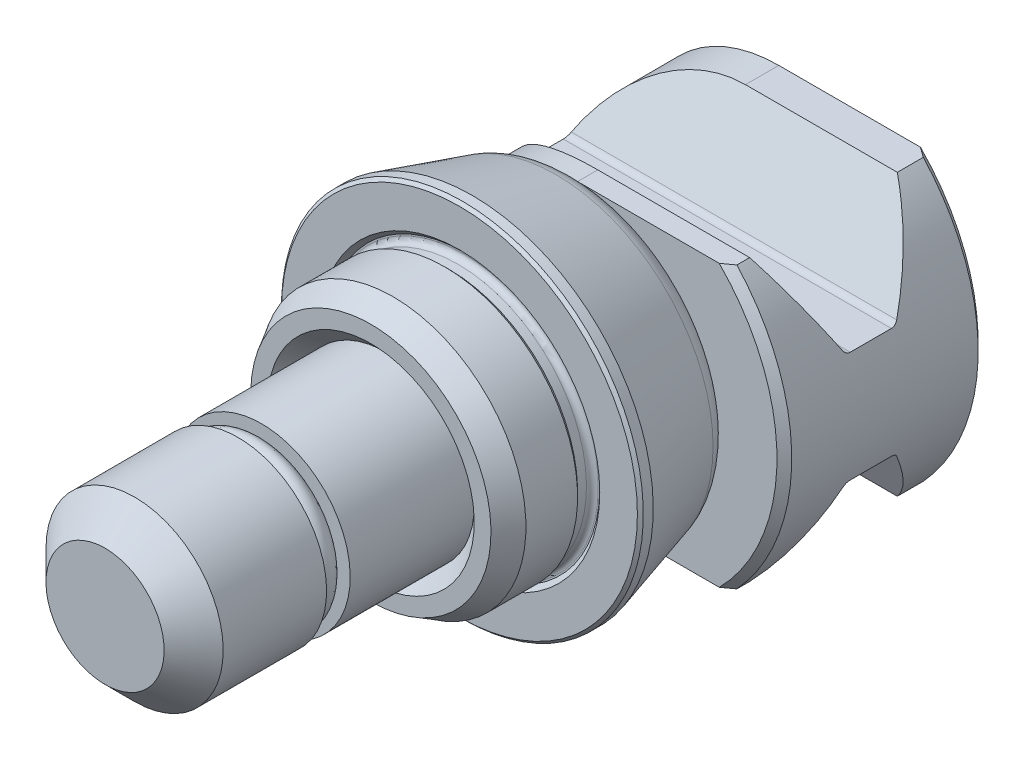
ISO-10303-21;
HEADER;
FILE_DESCRIPTION(('STEP AP214'),'2;1');
FILE_NAME('part.step','',(''),(''),'','','');
FILE_SCHEMA(('AUTOMOTIVE_DESIGN { 1 0 10303 214 1 1 1 1 }'));
ENDSEC;
DATA;
#1=APPLICATION_CONTEXT('core data for automotive mechanical design processes');
#2=APPLICATION_PROTOCOL_DEFINITION('international standard','automotive_design',2000,#1);
#3=PRODUCT_CONTEXT('',#1,'mechanical');
#4=PRODUCT('Part','Part','',(#3));
#5=PRODUCT_RELATED_PRODUCT_CATEGORY('part','',(#4));
#6=PRODUCT_DEFINITION_FORMATION('','',#4);
#7=PRODUCT_DEFINITION_CONTEXT('part definition',#1,'design');
#8=PRODUCT_DEFINITION('design','',#6,#7);
#9=PRODUCT_DEFINITION_SHAPE('','',#8);
#10=(LENGTH_UNIT() NAMED_UNIT(*) SI_UNIT(.MILLI.,.METRE.));
#11=(NAMED_UNIT(*) PLANE_ANGLE_UNIT() SI_UNIT($,.RADIAN.));
#12=(NAMED_UNIT(*) SI_UNIT($,.STERADIAN.) SOLID_ANGLE_UNIT());
#13=UNCERTAINTY_MEASURE_WITH_UNIT(LENGTH_MEASURE(1.E-05),#10,'distance_accuracy_value','');
#14=(GEOMETRIC_REPRESENTATION_CONTEXT(3) GLOBAL_UNCERTAINTY_ASSIGNED_CONTEXT((#13)) GLOBAL_UNIT_ASSIGNED_CONTEXT((#10,
#11,#12)) REPRESENTATION_CONTEXT('',''));
#15=CARTESIAN_POINT('',(0.,0.,0.));
#16=DIRECTION('',(0.,0.,1.));
#17=DIRECTION('',(1.,0.,0.));
#18=AXIS2_PLACEMENT_3D('',#15,#16,#17);
#19=CARTESIAN_POINT('',(4.8,0.,14.15));
#20=DIRECTION('',(0.,-1.,0.));
#21=DIRECTION('',(0.,0.,1.));
#22=AXIS2_PLACEMENT_3D('',#19,#20,#21);
#23=ELLIPSE('',#22,0.75,0.75);
#24=CARTESIAN_POINT('',(0.,0.,14.15));
#25=DIRECTION('',(0.,0.,-1.));
#26=AXIS1_PLACEMENT('',#24,#25);
#27=SURFACE_OF_REVOLUTION('',#23,#26);
#28=CARTESIAN_POINT('',(0.,0.,14.4));
#29=DIRECTION('',(0.,0.,-1.));
#30=DIRECTION('',(0.,1.,0.));
#31=AXIS2_PLACEMENT_3D('',#28,#29,#30);
#32=CIRCLE('',#31,4.09289321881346);
#33=CARTESIAN_POINT('',(0.,4.09289321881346,14.4));
#34=VERTEX_POINT('',#33);
#35=EDGE_CURVE('E24',#34,#34,#32,.F.);
#36=ORIENTED_EDGE('',*,*,#35,.F.);
#37=EDGE_LOOP('',(#36));
#38=FACE_BOUND('',#37,.T.);
#39=CARTESIAN_POINT('',(0.,0.,13.4));
#40=DIRECTION('',(0.,0.,-1.));
#41=DIRECTION('',(0.,1.,0.));
#42=AXIS2_PLACEMENT_3D('',#39,#40,#41);
#43=CIRCLE('',#42,4.8);
#44=CARTESIAN_POINT('',(0.,4.8,13.4));
#45=VERTEX_POINT('',#44);
#46=EDGE_CURVE('E9',#45,#45,#43,.F.);
#47=ORIENTED_EDGE('',*,*,#46,.T.);
#48=EDGE_LOOP('',(#47));
#49=FACE_BOUND('',#48,.T.);
#50=ADVANCED_FACE('F14',(#38,#49),#27,.F.);
#51=CARTESIAN_POINT('',(0.,0.,24.));
#52=DIRECTION('',(0.,0.,1.));
#53=DIRECTION('',(0.,1.,0.));
#54=AXIS2_PLACEMENT_3D('',#51,#52,#53);
#55=PLANE('',#54);
#56=CARTESIAN_POINT('',(0.,0.,24.));
#57=DIRECTION('',(0.,0.,1.));
#58=DIRECTION('',(0.,1.,0.));
#59=AXIS2_PLACEMENT_3D('',#56,#57,#58);
#60=CIRCLE('',#59,4.);
#61=CARTESIAN_POINT('',(0.,4.,24.));
#62=VERTEX_POINT('',#61);
#63=EDGE_CURVE('E299',#62,#62,#60,.T.);
#64=ORIENTED_EDGE('',*,*,#63,.T.);
#65=EDGE_LOOP('',(#64));
#66=FACE_BOUND('',#65,.T.);
#67=ADVANCED_FACE('F556',(#66),#55,.T.);
#68=CARTESIAN_POINT('',(0.,0.,22.));
#69=DIRECTION('',(0.,0.,-1.));
#70=DIRECTION('',(0.,-1.,0.));
#71=AXIS2_PLACEMENT_3D('',#68,#69,#70);
#72=CONICAL_SURFACE('',#71,6.,0.785398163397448);
#73=ORIENTED_EDGE('',*,*,#63,.F.);
#74=EDGE_LOOP('',(#73));
#75=FACE_BOUND('',#74,.T.);
#76=CARTESIAN_POINT('',(0.,0.,22.));
#77=DIRECTION('',(0.,0.,1.));
#78=DIRECTION('',(0.,1.,0.));
#79=AXIS2_PLACEMENT_3D('',#76,#77,#78);
#80=CIRCLE('',#79,6.);
#81=CARTESIAN_POINT('',(0.,6.,22.));
#82=VERTEX_POINT('',#81);
#83=EDGE_CURVE('E296',#82,#82,#80,.F.);
#84=ORIENTED_EDGE('',*,*,#83,.F.);
#85=EDGE_LOOP('',(#84));
#86=FACE_BOUND('',#85,.T.);
#87=ADVANCED_FACE('F376',(#75,#86),#72,.T.);
#88=CARTESIAN_POINT('',(0.,0.,-8.));
#89=DIRECTION('',(0.,0.,-1.));
#90=DIRECTION('',(0.,-1.,0.));
#91=AXIS2_PLACEMENT_3D('',#88,#89,#90);
#92=CYLINDRICAL_SURFACE('',#91,6.);
#93=CARTESIAN_POINT('',(0.,0.,15.));
#94=DIRECTION('',(0.,0.,-1.));
#95=DIRECTION('',(0.,-1.,0.));
#96=AXIS2_PLACEMENT_3D('',#93,#94,#95);
#97=CIRCLE('',#96,6.);
#98=CARTESIAN_POINT('',(0.,-6.,15.));
#99=VERTEX_POINT('',#98);
#100=EDGE_CURVE('E243',#99,#99,#97,.T.);
#101=ORIENTED_EDGE('',*,*,#100,.F.);
#102=EDGE_LOOP('',(#101));
#103=FACE_BOUND('',#102,.T.);
#104=ORIENTED_EDGE('',*,*,#83,.T.);
#105=EDGE_LOOP('',(#104));
#106=FACE_BOUND('',#105,.T.);
#107=ADVANCED_FACE('F646',(#103,#106),#92,.T.);
#108=CARTESIAN_POINT('',(-4.05,0.,15.));
#109=DIRECTION('',(0.,0.,1.));
#110=DIRECTION('',(0.,1.,0.));
#111=AXIS2_PLACEMENT_3D('',#108,#109,#110);
#112=PLANE('',#111);
#113=CARTESIAN_POINT('',(0.,0.,15.));
#114=DIRECTION('',(0.,0.,-1.));
#115=DIRECTION('',(0.,-1.,0.));
#116=AXIS2_PLACEMENT_3D('',#113,#114,#115);
#117=CIRCLE('',#116,4.05);
#118=CARTESIAN_POINT('',(0.,-4.05,15.));
#119=VERTEX_POINT('',#118);
#120=EDGE_CURVE('E240',#119,#119,#117,.T.);
#121=ORIENTED_EDGE('',*,*,#120,.F.);
#122=EDGE_LOOP('',(#121));
#123=FACE_BOUND('',#122,.T.);
#124=ORIENTED_EDGE('',*,*,#100,.T.);
#125=EDGE_LOOP('',(#124));
#126=FACE_BOUND('',#125,.T.);
#127=ADVANCED_FACE('F643',(#123,#126),#112,.F.);
#128=CARTESIAN_POINT('',(0.,0.,-8.));
#129=DIRECTION('',(0.,0.,-1.));
#130=DIRECTION('',(0.,-1.,0.));
#131=AXIS2_PLACEMENT_3D('',#128,#129,#130);
#132=CYLINDRICAL_SURFACE('',#131,4.05);
#133=CARTESIAN_POINT('',(0.,0.,14.4));
#134=DIRECTION('',(0.,0.,1.));
#135=DIRECTION('',(0.,1.,0.));
#136=AXIS2_PLACEMENT_3D('',#133,#134,#135);
#137=CIRCLE('',#136,4.05);
#138=CARTESIAN_POINT('',(0.,4.05,14.4));
#139=VERTEX_POINT('',#138);
#140=EDGE_CURVE('E19',#139,#139,#137,.T.);
#141=ORIENTED_EDGE('',*,*,#140,.T.);
#142=EDGE_LOOP('',(#141));
#143=FACE_BOUND('',#142,.T.);
#144=ORIENTED_EDGE('',*,*,#120,.T.);
#145=EDGE_LOOP('',(#144));
#146=FACE_BOUND('',#145,.T.);
#147=ADVANCED_FACE('F616',(#143,#146),#132,.T.);
#148=CARTESIAN_POINT('',(0.,0.,14.4));
#149=DIRECTION('',(0.,0.,1.));
#150=DIRECTION('',(0.,1.,0.));
#151=AXIS2_PLACEMENT_3D('',#148,#149,#150);
#152=PLANE('',#151);
#153=ORIENTED_EDGE('',*,*,#140,.F.);
#154=EDGE_LOOP('',(#153));
#155=FACE_BOUND('',#154,.T.);
#156=ORIENTED_EDGE('',*,*,#35,.T.);
#157=EDGE_LOOP('',(#156));
#158=FACE_BOUND('',#157,.T.);
#159=ADVANCED_FACE('F559',(#155,#158),#152,.T.);
#160=CARTESIAN_POINT('',(0.,0.,5.));
#161=DIRECTION('',(0.,0.,1.));
#162=DIRECTION('',(0.,-1.,0.));
#163=AXIS2_PLACEMENT_3D('',#160,#161,#162);
#164=CIRCLE('',#163,6.);
#165=CARTESIAN_POINT('',(0.,-6.,5.));
#166=VERTEX_POINT('',#165);
#167=EDGE_CURVE('E533',#166,#166,#164,.T.);
#168=ORIENTED_EDGE('',*,*,#167,.T.);
#169=EDGE_LOOP('',(#168));
#170=FACE_BOUND('',#169,.T.);
#171=CARTESIAN_POINT('',(0.,0.,13.4));
#172=DIRECTION('',(0.,0.,-1.));
#173=DIRECTION('',(0.,-1.,0.));
#174=AXIS2_PLACEMENT_3D('',#171,#172,#173);
#175=CIRCLE('',#174,6.);
#176=CARTESIAN_POINT('',(0.,-6.,13.4));
#177=VERTEX_POINT('',#176);
#178=EDGE_CURVE('E246',#177,#177,#175,.T.);
#179=ORIENTED_EDGE('',*,*,#178,.T.);
#180=EDGE_LOOP('',(#179));
#181=FACE_BOUND('',#180,.T.);
#182=ADVANCED_FACE('F415',(#170,#181),#92,.T.);
#183=CARTESIAN_POINT('',(-4.05,0.,13.4));
#184=DIRECTION('',(0.,0.,-1.));
#185=DIRECTION('',(0.,-1.,0.));
#186=AXIS2_PLACEMENT_3D('',#183,#184,#185);
#187=PLANE('',#186);
#188=ORIENTED_EDGE('',*,*,#46,.F.);
#189=EDGE_LOOP('',(#188));
#190=FACE_BOUND('',#189,.T.);
#191=ORIENTED_EDGE('',*,*,#178,.F.);
#192=EDGE_LOOP('',(#191));
#193=FACE_BOUND('',#192,.T.);
#194=ADVANCED_FACE('F558',(#190,#193),#187,.F.);
#195=CARTESIAN_POINT('',(0.,0.,-8.));
#196=DIRECTION('',(0.,0.,1.));
#197=DIRECTION('',(0.,1.,0.));
#198=AXIS2_PLACEMENT_3D('',#195,#196,#197);
#199=PLANE('',#198);
#200=CARTESIAN_POINT('',(0.,0.,-8.));
#201=DIRECTION('',(0.,0.,-1.));
#202=DIRECTION('',(0.,1.,0.));
#203=AXIS2_PLACEMENT_3D('',#200,#201,#202);
#204=CIRCLE('',#203,8.69892881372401);
#205=CARTESIAN_POINT('',(0.,8.69892881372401,-8.));
#206=VERTEX_POINT('',#205);
#207=EDGE_CURVE('E518',#206,#206,#204,.T.);
#208=ORIENTED_EDGE('',*,*,#207,.T.);
#209=EDGE_LOOP('',(#208));
#210=FACE_BOUND('',#209,.T.);
#211=DIRECTION('',(-1.,0.,0.));
#212=VECTOR('',#211,1.);
#213=CARTESIAN_POINT('',(0.,-9.5,-8.));
#214=LINE('',#213,#212);
#215=CARTESIAN_POINT('',(9.59166304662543,-9.5,-8.));
#216=VERTEX_POINT('',#215);
#217=CARTESIAN_POINT('',(0.,-9.5,-8.));
#218=VERTEX_POINT('',#217);
#219=EDGE_CURVE('E302',#216,#218,#214,.T.);
#220=ORIENTED_EDGE('',*,*,#219,.F.);
#221=CARTESIAN_POINT('',(0.,0.,-8.));
#222=DIRECTION('',(0.,0.,1.));
#223=DIRECTION('',(0.,1.,0.));
#224=AXIS2_PLACEMENT_3D('',#221,#222,#223);
#225=CIRCLE('',#224,13.5);
#226=CARTESIAN_POINT('',(9.59166304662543,9.5,-8.));
#227=VERTEX_POINT('',#226);
#228=EDGE_CURVE('E463',#216,#227,#225,.T.);
#229=ORIENTED_EDGE('',*,*,#228,.T.);
#230=DIRECTION('',(1.,0.,0.));
#231=VECTOR('',#230,1.);
#232=CARTESIAN_POINT('',(0.,9.5,-8.));
#233=LINE('',#232,#231);
#234=CARTESIAN_POINT('',(0.,9.5,-8.));
#235=VERTEX_POINT('',#234);
#236=EDGE_CURVE('E304',#235,#227,#233,.T.);
#237=ORIENTED_EDGE('',*,*,#236,.F.);
#238=CARTESIAN_POINT('',(0.,0.,-8.));
#239=DIRECTION('',(0.,0.,-1.));
#240=DIRECTION('',(0.,1.,0.));
#241=AXIS2_PLACEMENT_3D('',#238,#239,#240);
#242=CIRCLE('',#241,9.5);
#243=EDGE_CURVE('E280',#218,#235,#242,.T.);
#244=ORIENTED_EDGE('',*,*,#243,.F.);
#245=EDGE_LOOP('',(#220,#229,#237,#244));
#246=FACE_BOUND('',#245,.T.);
#247=ADVANCED_FACE('F413',(#210,#246),#199,.T.);
#248=CARTESIAN_POINT('',(15.,-9.5,-56.4039906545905));
#249=DIRECTION('',(0.,1.,0.));
#250=DIRECTION('',(0.,0.,-1.));
#251=AXIS2_PLACEMENT_3D('',#248,#249,#250);
#252=PLANE('',#251);
#253=DIRECTION('',(0.,0.,-1.));
#254=VECTOR('',#253,1.);
#255=CARTESIAN_POINT('',(10.2834819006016,-9.5,-8.));
#256=LINE('',#255,#254);
#257=CARTESIAN_POINT('',(10.2834819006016,-9.5,-9.3674137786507));
#258=VERTEX_POINT('',#257);
#259=CARTESIAN_POINT('',(10.2834819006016,-9.5,-8.5));
#260=VERTEX_POINT('',#259);
#261=EDGE_CURVE('E292',#258,#260,#256,.F.);
#262=ORIENTED_EDGE('',*,*,#261,.T.);
#263=CARTESIAN_POINT('',(10.2834819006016,-9.5,-8.5));
#264=CARTESIAN_POINT('',(10.1688365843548,-9.5,-8.41575654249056));
#265=CARTESIAN_POINT('',(10.0538623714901,-9.5,-8.33196815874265));
#266=CARTESIAN_POINT('',(9.82325608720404,-9.5,-8.16530149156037));
#267=CARTESIAN_POINT('',(9.70762401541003,-9.5,-8.08242320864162));
#268=CARTESIAN_POINT('',(9.59166304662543,-9.5,-8.));
#269=B_SPLINE_CURVE_WITH_KNOTS('',3,(#263,#264,#265,#266,#267,#268),.UNSPECIFIED.,.F.,.F.,(4,2,
4),(0.,0.426797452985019,0.853595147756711),.UNSPECIFIED.);
#270=EDGE_CURVE('E449',#260,#216,#269,.T.);
#271=ORIENTED_EDGE('',*,*,#270,.T.);
#272=ORIENTED_EDGE('',*,*,#219,.T.);
#273=DIRECTION('',(0.,0.,1.));
#274=VECTOR('',#273,1.);
#275=CARTESIAN_POINT('',(0.,-9.5,-40.));
#276=LINE('',#275,#274);
#277=CARTESIAN_POINT('',(0.,-9.5,-9.3674137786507));
#278=VERTEX_POINT('',#277);
#279=EDGE_CURVE('E283',#278,#218,#276,.T.);
#280=ORIENTED_EDGE('',*,*,#279,.F.);
#281=DIRECTION('',(1.,0.,0.));
#282=VECTOR('',#281,1.);
#283=CARTESIAN_POINT('',(15.,-9.5,-9.3674137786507));
#284=LINE('',#283,#282);
#285=EDGE_CURVE('E312',#278,#258,#284,.T.);
#286=ORIENTED_EDGE('',*,*,#285,.T.);
#287=EDGE_LOOP('',(#262,#271,#272,#280,#286));
#288=FACE_BOUND('',#287,.T.);
#289=ADVANCED_FACE('F411',(#288),#252,.F.);
#290=CARTESIAN_POINT('',(0.,0.,-8.5));
#291=DIRECTION('',(0.,0.,-1.));
#292=DIRECTION('',(0.,-1.,0.));
#293=AXIS2_PLACEMENT_3D('',#290,#291,#292);
#294=CONICAL_SURFACE('',#293,14.,0.785398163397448);
#295=CARTESIAN_POINT('',(9.59166304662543,9.5,-8.));
#296=CARTESIAN_POINT('',(9.70762401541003,9.50000000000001,-8.08242320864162));
#297=CARTESIAN_POINT('',(9.82325608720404,9.50000000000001,-8.16530149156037));
#298=CARTESIAN_POINT('',(10.0538623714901,9.50000000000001,-8.33196815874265));
#299=CARTESIAN_POINT('',(10.1688365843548,9.50000000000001,-8.41575654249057));
#300=CARTESIAN_POINT('',(10.2834819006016,9.5,-8.5));
#301=B_SPLINE_CURVE_WITH_KNOTS('',3,(#295,#296,#297,#298,#299,#300),.UNSPECIFIED.,.F.,.F.,(4,2,
4),(0.,0.426797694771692,0.853595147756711),.UNSPECIFIED.);
#302=CARTESIAN_POINT('',(10.2834819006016,9.5,-8.5));
#303=VERTEX_POINT('',#302);
#304=EDGE_CURVE('E456',#227,#303,#301,.T.);
#305=ORIENTED_EDGE('',*,*,#304,.F.);
#306=ORIENTED_EDGE('',*,*,#228,.F.);
#307=ORIENTED_EDGE('',*,*,#270,.F.);
#308=CARTESIAN_POINT('',(0.,0.,-8.5));
#309=DIRECTION('',(0.,0.,1.));
#310=DIRECTION('',(0.,1.,0.));
#311=AXIS2_PLACEMENT_3D('',#308,#309,#310);
#312=CIRCLE('',#311,14.);
#313=EDGE_CURVE('E983',#303,#260,#312,.F.);
#314=ORIENTED_EDGE('',*,*,#313,.F.);
#315=EDGE_LOOP('',(#305,#306,#307,#314));
#316=FACE_BOUND('',#315,.T.);
#317=ADVANCED_FACE('F442',(#316),#294,.T.);
#318=CARTESIAN_POINT('',(15.,9.5,-56.4039906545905));
#319=DIRECTION('',(0.,-1.,0.));
#320=DIRECTION('',(0.,0.,1.));
#321=AXIS2_PLACEMENT_3D('',#318,#319,#320);
#322=PLANE('',#321);
#323=ORIENTED_EDGE('',*,*,#236,.T.);
#324=ORIENTED_EDGE('',*,*,#304,.T.);
#325=DIRECTION('',(0.,0.,-1.));
#326=VECTOR('',#325,1.);
#327=CARTESIAN_POINT('',(10.2834819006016,9.5,-8.));
#328=LINE('',#327,#326);
#329=CARTESIAN_POINT('',(10.2834819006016,9.5,-9.3674137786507));
#330=VERTEX_POINT('',#329);
#331=EDGE_CURVE('E290',#303,#330,#328,.T.);
#332=ORIENTED_EDGE('',*,*,#331,.T.);
#333=DIRECTION('',(-1.,0.,0.));
#334=VECTOR('',#333,1.);
#335=CARTESIAN_POINT('',(15.,9.5,-9.3674137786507));
#336=LINE('',#335,#334);
#337=CARTESIAN_POINT('',(0.,9.5,-9.3674137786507));
#338=VERTEX_POINT('',#337);
#339=EDGE_CURVE('E254',#330,#338,#336,.T.);
#340=ORIENTED_EDGE('',*,*,#339,.T.);
#341=DIRECTION('',(0.,0.,1.));
#342=VECTOR('',#341,1.);
#343=CARTESIAN_POINT('',(0.,9.5,-40.));
#344=LINE('',#343,#342);
#345=EDGE_CURVE('E284',#338,#235,#344,.T.);
#346=ORIENTED_EDGE('',*,*,#345,.T.);
#347=EDGE_LOOP('',(#323,#324,#332,#340,#346));
#348=FACE_BOUND('',#347,.T.);
#349=ADVANCED_FACE('F412',(#348),#322,.F.);
#350=CARTESIAN_POINT('',(0.,0.,-40.));
#351=DIRECTION('',(0.,0.,1.));
#352=DIRECTION('',(0.,1.,0.));
#353=AXIS2_PLACEMENT_3D('',#350,#351,#352);
#354=CYLINDRICAL_SURFACE('',#353,9.5);
#355=CARTESIAN_POINT('',(0.,0.,-13.8825862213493));
#356=DIRECTION('',(0.,0.5,0.86602540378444));
#357=DIRECTION('',(0.,-0.866025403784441,0.5));
#358=AXIS2_PLACEMENT_3D('',#355,#356,#357);
#359=ELLIPSE('',#358,10.9696551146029,9.5);
#360=CARTESIAN_POINT('',(0.,9.5,-19.3674137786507));
#361=VERTEX_POINT('',#360);
#362=CARTESIAN_POINT('',(-8.61684396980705,4.,-16.1919872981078));
#363=VERTEX_POINT('',#362);
#364=EDGE_CURVE('E261',#361,#363,#359,.T.);
#365=ORIENTED_EDGE('',*,*,#364,.F.);
#366=CARTESIAN_POINT('',(0.,9.5,-21.625));
#367=VERTEX_POINT('',#366);
#368=EDGE_CURVE('E286',#367,#361,#344,.T.);
#369=ORIENTED_EDGE('',*,*,#368,.F.);
#370=CARTESIAN_POINT('',(0.,0.,-21.625));
#371=DIRECTION('',(0.,0.,1.));
#372=DIRECTION('',(0.,1.,0.));
#373=AXIS2_PLACEMENT_3D('',#370,#371,#372);
#374=CIRCLE('',#373,9.5);
#375=CARTESIAN_POINT('',(0.,-9.5,-21.625));
#376=VERTEX_POINT('',#375);
#377=EDGE_CURVE('E307',#367,#376,#374,.T.);
#378=ORIENTED_EDGE('',*,*,#377,.T.);
#379=CARTESIAN_POINT('',(0.,-9.5,-19.3674137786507));
#380=VERTEX_POINT('',#379);
#381=EDGE_CURVE('E287',#376,#380,#276,.T.);
#382=ORIENTED_EDGE('',*,*,#381,.T.);
#383=CARTESIAN_POINT('',(0.,0.,-13.8825862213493));
#384=DIRECTION('',(0.,0.5,-0.86602540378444));
#385=DIRECTION('',(0.,0.866025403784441,0.5));
#386=AXIS2_PLACEMENT_3D('',#383,#384,#385);
#387=ELLIPSE('',#386,10.9696551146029,9.5);
#388=CARTESIAN_POINT('',(-8.61684396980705,-4.,-16.1919872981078));
#389=VERTEX_POINT('',#388);
#390=EDGE_CURVE('E270',#380,#389,#387,.T.);
#391=ORIENTED_EDGE('',*,*,#390,.T.);
#392=CARTESIAN_POINT('',(-8.61684396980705,-4.,-16.1919872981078));
#393=CARTESIAN_POINT('',(-8.62782988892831,-3.9763405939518,-16.1783539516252));
#394=CARTESIAN_POINT('',(-8.63826486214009,-3.95359947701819,-16.1626141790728));
#395=CARTESIAN_POINT('',(-8.65779662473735,-3.91063964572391,-16.1272210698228));
#396=CARTESIAN_POINT('',(-8.66689002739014,-3.89042733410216,-16.1075581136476));
#397=CARTESIAN_POINT('',(-8.6834728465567,-3.85327385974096,-16.064617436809));
#398=CARTESIAN_POINT('',(-8.6909568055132,-3.83634384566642,-16.0413278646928));
#399=CARTESIAN_POINT('',(-8.70402475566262,-3.8066016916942,-15.9918471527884));
#400=CARTESIAN_POINT('',(-8.709613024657,-3.79378028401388,-15.9656627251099));
#401=CARTESIAN_POINT('',(-8.7188728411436,-3.77245264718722,-15.9101689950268));
#402=CARTESIAN_POINT('',(-8.72247157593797,-3.76411063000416,-15.8807830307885));
#403=CARTESIAN_POINT('',(-8.72610105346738,-3.75568486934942,-15.8357221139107));
#404=CARTESIAN_POINT('',(-8.7270161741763,-3.75355728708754,-15.8204707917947));
#405=CARTESIAN_POINT('',(-8.7282383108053,-3.75071422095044,-15.7898080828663));
#406=CARTESIAN_POINT('',(-8.7285451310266,-3.74999919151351,-15.7743966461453));
#407=CARTESIAN_POINT('',(-8.72854512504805,-3.75,-15.7589745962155));
#408=B_SPLINE_CURVE_WITH_KNOTS('',3,(#392,#393,#394,#395,#396,#397,#398,#399,#400,#401,#402,
#403,#404,#405,#406,#407),.UNSPECIFIED.,.F.,.F.,(4,2,2,2,2,2,2,4),(0.,0.0882580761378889,
0.176735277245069,0.265507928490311,0.354078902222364,0.445706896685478,0.491917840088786,
0.538143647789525),.UNSPECIFIED.);
#409=CARTESIAN_POINT('',(-8.72854512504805,-3.75,-15.7589745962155));
#410=VERTEX_POINT('',#409);
#411=EDGE_CURVE('E347',#389,#410,#408,.T.);
#412=ORIENTED_EDGE('',*,*,#411,.T.);
#413=DIRECTION('',(0.,0.,1.));
#414=VECTOR('',#413,1.);
#415=CARTESIAN_POINT('',(-8.72854512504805,-3.75,-40.));
#416=LINE('',#415,#414);
#417=CARTESIAN_POINT('',(-8.72854512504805,-3.75,-12.9758529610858));
#418=VERTEX_POINT('',#417);
#419=EDGE_CURVE('E277',#410,#418,#416,.T.);
#420=ORIENTED_EDGE('',*,*,#419,.T.);
#421=CARTESIAN_POINT('',(-8.72854512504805,-3.75,-12.9758529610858));
#422=CARTESIAN_POINT('',(-8.72855476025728,-3.74996956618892,-12.9494301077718));
#423=CARTESIAN_POINT('',(-8.72764615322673,-3.75209240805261,-12.9230258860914));
#424=CARTESIAN_POINT('',(-8.72406873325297,-3.76040700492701,-12.8710645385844));
#425=CARTESIAN_POINT('',(-8.72140503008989,-3.76658694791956,-12.8455051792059));
#426=CARTESIAN_POINT('',(-8.71439385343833,-3.78277840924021,-12.7958883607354));
#427=CARTESIAN_POINT('',(-8.71004683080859,-3.792788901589,-12.7718305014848));
#428=CARTESIAN_POINT('',(-8.69979515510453,-3.81624533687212,-12.7258049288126));
#429=CARTESIAN_POINT('',(-8.69388960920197,-3.82969324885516,-12.7038384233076));
#430=CARTESIAN_POINT('',(-8.68047873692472,-3.85999626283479,-12.6618661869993));
#431=CARTESIAN_POINT('',(-8.67293032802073,-3.87694232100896,-12.6419401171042));
#432=CARTESIAN_POINT('',(-8.65654704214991,-3.91338591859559,-12.6052333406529));
#433=CARTESIAN_POINT('',(-8.64771293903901,-3.93288192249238,-12.5884507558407));
#434=CARTESIAN_POINT('',(-8.63145164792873,-3.9684156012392,-12.5622562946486));
#435=CARTESIAN_POINT('',(-8.62427227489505,-3.98400005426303,-12.5520698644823));
#436=CARTESIAN_POINT('',(-8.61684396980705,-4.,-12.5428402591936));
#437=B_SPLINE_CURVE_WITH_KNOTS('',3,(#421,#422,#423,#424,#425,#426,#427,#428,#429,#430,#431,
#432,#433,#434,#435,#436),.UNSPECIFIED.,.F.,.F.,(4,2,2,2,2,2,2,4),(0.,0.0791389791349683,
0.15804856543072,0.236937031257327,0.31587078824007,0.397198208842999,0.478476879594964,
0.538209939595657),.UNSPECIFIED.);
#438=CARTESIAN_POINT('',(-8.61684396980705,-4.,-12.5428402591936));
#439=VERTEX_POINT('',#438);
#440=EDGE_CURVE('E387',#418,#439,#437,.T.);
#441=ORIENTED_EDGE('',*,*,#440,.T.);
#442=CARTESIAN_POINT('',(0.,0.,-14.8522413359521));
#443=DIRECTION('',(0.,0.5,0.86602540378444));
#444=DIRECTION('',(0.,-0.86602540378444,0.5));
#445=AXIS2_PLACEMENT_3D('',#442,#443,#444);
#446=ELLIPSE('',#445,10.9696551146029,9.5);
#447=EDGE_CURVE('E275',#439,#278,#446,.T.);
#448=ORIENTED_EDGE('',*,*,#447,.T.);
#449=ORIENTED_EDGE('',*,*,#279,.T.);
#450=ORIENTED_EDGE('',*,*,#243,.T.);
#451=ORIENTED_EDGE('',*,*,#345,.F.);
#452=CARTESIAN_POINT('',(0.,0.,-14.8522413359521));
#453=DIRECTION('',(0.,0.5,-0.86602540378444));
#454=DIRECTION('',(0.,0.86602540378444,0.5));
#455=AXIS2_PLACEMENT_3D('',#452,#453,#454);
#456=ELLIPSE('',#455,10.9696551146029,9.5);
#457=CARTESIAN_POINT('',(-8.61684396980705,4.,-12.5428402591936));
#458=VERTEX_POINT('',#457);
#459=EDGE_CURVE('E257',#458,#338,#456,.T.);
#460=ORIENTED_EDGE('',*,*,#459,.F.);
#461=CARTESIAN_POINT('',(-8.61684396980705,4.,-12.5428402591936));
#462=CARTESIAN_POINT('',(-8.62782988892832,3.97634059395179,-12.5564736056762));
#463=CARTESIAN_POINT('',(-8.63826486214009,3.95359947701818,-12.5722133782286));
#464=CARTESIAN_POINT('',(-8.65779662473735,3.9106396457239,-12.6076064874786));
#465=CARTESIAN_POINT('',(-8.66689002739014,3.89042733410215,-12.6272694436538));
#466=CARTESIAN_POINT('',(-8.6834728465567,3.85327385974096,-12.6702101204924));
#467=CARTESIAN_POINT('',(-8.6909568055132,3.83634384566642,-12.6934996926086));
#468=CARTESIAN_POINT('',(-8.70402475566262,3.8066016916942,-12.742980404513));
#469=CARTESIAN_POINT('',(-8.709613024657,3.79378028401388,-12.7691648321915));
#470=CARTESIAN_POINT('',(-8.7188728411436,3.77245264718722,-12.8246585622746));
#471=CARTESIAN_POINT('',(-8.72247157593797,3.76411063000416,-12.854044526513));
#472=CARTESIAN_POINT('',(-8.72610105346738,3.75568486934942,-12.8991054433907));
#473=CARTESIAN_POINT('',(-8.7270161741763,3.75355728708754,-12.9143567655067));
#474=CARTESIAN_POINT('',(-8.7282383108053,3.75071422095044,-12.9450194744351));
#475=CARTESIAN_POINT('',(-8.7285451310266,3.74999919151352,-12.9604309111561));
#476=CARTESIAN_POINT('',(-8.72854512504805,3.75,-12.9758529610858));
#477=B_SPLINE_CURVE_WITH_KNOTS('',3,(#461,#462,#463,#464,#465,#466,#467,#468,#469,#470,#471,
#472,#473,#474,#475,#476),.UNSPECIFIED.,.F.,.F.,(4,2,2,2,2,2,2,4),(0.,0.0882580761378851,
0.176735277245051,0.26550792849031,0.354078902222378,0.445706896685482,0.491917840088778,
0.538143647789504),.UNSPECIFIED.);
#478=CARTESIAN_POINT('',(-8.72854512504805,3.75,-12.9758529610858));
#479=VERTEX_POINT('',#478);
#480=EDGE_CURVE('E399',#458,#479,#477,.T.);
#481=ORIENTED_EDGE('',*,*,#480,.T.);
#482=DIRECTION('',(0.,0.,1.));
#483=VECTOR('',#482,1.);
#484=CARTESIAN_POINT('',(-8.72854512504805,3.75,-40.));
#485=LINE('',#484,#483);
#486=CARTESIAN_POINT('',(-8.72854512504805,3.75,-15.7589745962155));
#487=VERTEX_POINT('',#486);
#488=EDGE_CURVE('E264',#487,#479,#485,.T.);
#489=ORIENTED_EDGE('',*,*,#488,.F.);
#490=CARTESIAN_POINT('',(-8.72854512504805,3.75,-15.7589745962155));
#491=CARTESIAN_POINT('',(-8.72855476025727,3.74996956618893,-15.7853974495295));
#492=CARTESIAN_POINT('',(-8.72764615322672,3.75209240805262,-15.81180167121));
#493=CARTESIAN_POINT('',(-8.72406873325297,3.76040700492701,-15.863763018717));
#494=CARTESIAN_POINT('',(-8.7214050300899,3.76658694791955,-15.8893223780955));
#495=CARTESIAN_POINT('',(-8.71439385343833,3.78277840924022,-15.938939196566));
#496=CARTESIAN_POINT('',(-8.71004683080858,3.79278890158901,-15.9629970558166));
#497=CARTESIAN_POINT('',(-8.69979515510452,3.81624533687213,-16.0090226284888));
#498=CARTESIAN_POINT('',(-8.69388960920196,3.82969324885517,-16.0309891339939));
#499=CARTESIAN_POINT('',(-8.68047873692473,3.85999626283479,-16.0729613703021));
#500=CARTESIAN_POINT('',(-8.67293032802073,3.87694232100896,-16.0928874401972));
#501=CARTESIAN_POINT('',(-8.65654704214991,3.91338591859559,-16.1295942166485));
#502=CARTESIAN_POINT('',(-8.647712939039,3.93288192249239,-16.1463768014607));
#503=CARTESIAN_POINT('',(-8.63145164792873,3.96841560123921,-16.1725712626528));
#504=CARTESIAN_POINT('',(-8.62427227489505,3.98400005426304,-16.1827576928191));
#505=CARTESIAN_POINT('',(-8.61684396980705,4.,-16.1919872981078));
#506=B_SPLINE_CURVE_WITH_KNOTS('',3,(#490,#491,#492,#493,#494,#495,#496,#497,#498,#499,#500,
#501,#502,#503,#504,#505),.UNSPECIFIED.,.F.,.F.,(4,2,2,2,2,2,2,4),(0.,0.0791389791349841,
0.158048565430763,0.236937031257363,0.315870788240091,0.397198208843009,0.478476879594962,
0.538209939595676),.UNSPECIFIED.);
#507=EDGE_CURVE('E426',#487,#363,#506,.T.);
#508=ORIENTED_EDGE('',*,*,#507,.T.);
#509=EDGE_LOOP('',(#365,#369,#378,#382,#391,#412,#420,#441,#448,#449,#450,#451,#460,#481,#489,#508));
#510=FACE_BOUND('',#509,.T.);
#511=ADVANCED_FACE('F362',(#510),#354,.T.);
#512=CARTESIAN_POINT('',(0.,0.,-8.));
#513=DIRECTION('',(0.,0.,-1.));
#514=DIRECTION('',(0.,-1.,0.));
#515=AXIS2_PLACEMENT_3D('',#512,#513,#514);
#516=CYLINDRICAL_SURFACE('',#515,14.);
#517=CARTESIAN_POINT('',(10.2834819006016,-9.5,-21.125));
#518=VERTEX_POINT('',#517);
#519=CARTESIAN_POINT('',(10.2834819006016,-9.5,-19.3674137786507));
#520=VERTEX_POINT('',#519);
#521=EDGE_CURVE('E294',#518,#520,#256,.F.);
#522=ORIENTED_EDGE('',*,*,#521,.F.);
#523=CARTESIAN_POINT('',(0.,0.,-21.125));
#524=DIRECTION('',(0.,0.,1.));
#525=DIRECTION('',(0.,1.,0.));
#526=AXIS2_PLACEMENT_3D('',#523,#524,#525);
#527=CIRCLE('',#526,14.);
#528=CARTESIAN_POINT('',(10.2834819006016,9.5,-21.125));
#529=VERTEX_POINT('',#528);
#530=EDGE_CURVE('E40',#518,#529,#527,.T.);
#531=ORIENTED_EDGE('',*,*,#530,.T.);
#532=CARTESIAN_POINT('',(10.2834819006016,9.5,-19.3674137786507));
#533=VERTEX_POINT('',#532);
#534=EDGE_CURVE('E293',#533,#529,#328,.T.);
#535=ORIENTED_EDGE('',*,*,#534,.F.);
#536=CARTESIAN_POINT('',(0.,0.,-13.8825862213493));
#537=DIRECTION('',(0.,0.5,0.86602540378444));
#538=DIRECTION('',(0.,0.866025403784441,-0.5));
#539=AXIS2_PLACEMENT_3D('',#536,#537,#538);
#540=ELLIPSE('',#539,16.1658075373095,14.);
#541=CARTESIAN_POINT('',(13.4164078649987,4.,-16.1919872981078));
#542=VERTEX_POINT('',#541);
#543=EDGE_CURVE('E324',#533,#542,#540,.F.);
#544=ORIENTED_EDGE('',*,*,#543,.T.);
#545=CARTESIAN_POINT('',(13.4164078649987,4.,-16.1919872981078));
#546=CARTESIAN_POINT('',(13.4235732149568,3.97597138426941,-16.1781420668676));
#547=CARTESIAN_POINT('',(13.430343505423,3.95302243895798,-16.1622011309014));
#548=CARTESIAN_POINT('',(13.442947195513,3.90994436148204,-16.1265844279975));
#549=CARTESIAN_POINT('',(13.4487806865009,3.88981495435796,-16.1069090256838));
#550=CARTESIAN_POINT('',(13.4593755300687,3.85299648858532,-16.0642365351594));
#551=CARTESIAN_POINT('',(13.4641348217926,3.83631404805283,-16.0412331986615));
#552=CARTESIAN_POINT('',(13.4724456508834,3.8070250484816,-15.9925959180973));
#553=CARTESIAN_POINT('',(13.4759981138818,3.79441536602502,-15.9669640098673));
#554=CARTESIAN_POINT('',(13.4820367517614,3.77290630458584,-15.9117007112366));
#555=CARTESIAN_POINT('',(13.4844186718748,3.76437119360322,-15.8819133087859));
#556=CARTESIAN_POINT('',(13.486813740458,3.7557772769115,-15.8363443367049));
#557=CARTESIAN_POINT('',(13.4874158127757,3.75361399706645,-15.8209603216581));
#558=CARTESIAN_POINT('',(13.4882193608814,3.7507252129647,-15.7900457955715));
#559=CARTESIAN_POINT('',(13.488420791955,3.74999986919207,-15.7745152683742));
#560=CARTESIAN_POINT('',(13.4884209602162,3.75,-15.7589745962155));
#561=B_SPLINE_CURVE_WITH_KNOTS('',3,(#545,#546,#547,#548,#549,#550,#551,#552,#553,#554,#555,
#556,#557,#558,#559,#560),.UNSPECIFIED.,.F.,.F.,(4,2,2,2,2,2,2,4),(0.,0.085846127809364,
0.171683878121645,0.257684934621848,0.343619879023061,0.436229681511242,0.482808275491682,
0.529392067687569),.UNSPECIFIED.);
#562=CARTESIAN_POINT('',(13.4884209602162,3.75,-15.7589745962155));
#563=VERTEX_POINT('',#562);
#564=EDGE_CURVE('E431',#542,#563,#561,.T.);
#565=ORIENTED_EDGE('',*,*,#564,.T.);
#566=DIRECTION('',(0.,0.,-1.));
#567=VECTOR('',#566,1.);
#568=CARTESIAN_POINT('',(13.4884209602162,3.75,-8.));
#569=LINE('',#568,#567);
#570=CARTESIAN_POINT('',(13.4884209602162,3.75,-12.9758529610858));
#571=VERTEX_POINT('',#570);
#572=EDGE_CURVE('E321',#563,#571,#569,.F.);
#573=ORIENTED_EDGE('',*,*,#572,.T.);
#574=CARTESIAN_POINT('',(13.4884209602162,3.75,-12.9758529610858));
#575=CARTESIAN_POINT('',(13.4884261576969,3.74997276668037,-12.9484923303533));
#576=CARTESIAN_POINT('',(13.4877970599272,3.75224401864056,-12.921144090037));
#577=CARTESIAN_POINT('',(13.4853104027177,3.76117556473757,-12.8672856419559));
#578=CARTESIAN_POINT('',(13.4834552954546,3.76782709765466,-12.8407738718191));
#579=CARTESIAN_POINT('',(13.4785562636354,3.78531348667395,-12.7892843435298));
#580=CARTESIAN_POINT('',(13.4755122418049,3.79614868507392,-12.7643067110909));
#581=CARTESIAN_POINT('',(13.4683054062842,3.82163908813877,-12.7165472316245));
#582=CARTESIAN_POINT('',(13.4641420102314,3.83629628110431,-12.6937665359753));
#583=CARTESIAN_POINT('',(13.4547225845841,3.86920363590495,-12.6506751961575));
#584=CARTESIAN_POINT('',(13.449451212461,3.88750403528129,-12.6304063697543));
#585=CARTESIAN_POINT('',(13.4379808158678,3.92696964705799,-12.5932517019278));
#586=CARTESIAN_POINT('',(13.4317831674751,3.94813060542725,-12.5763609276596));
#587=CARTESIAN_POINT('',(13.4223377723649,3.98006941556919,-12.5548129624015));
#588=CARTESIAN_POINT('',(13.4194063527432,3.98994333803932,-12.5486435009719));
#589=CARTESIAN_POINT('',(13.4164078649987,4.,-12.5428402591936));
#590=B_SPLINE_CURVE_WITH_KNOTS('',3,(#574,#575,#576,#577,#578,#579,#580,#581,#582,#583,#584,
#585,#586,#587,#588,#589),.UNSPECIFIED.,.F.,.F.,(4,2,2,2,2,2,2,4),(0.,0.0819618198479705,
0.163760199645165,0.245565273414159,0.327412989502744,0.410479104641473,0.493423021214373,
0.529410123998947),.UNSPECIFIED.);
#591=CARTESIAN_POINT('',(13.4164078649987,4.,-12.5428402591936));
#592=VERTEX_POINT('',#591);
#593=EDGE_CURVE('E420',#571,#592,#590,.T.);
#594=ORIENTED_EDGE('',*,*,#593,.T.);
#595=CARTESIAN_POINT('',(0.,0.,-14.8522413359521));
#596=DIRECTION('',(0.,0.5,-0.86602540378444));
#597=DIRECTION('',(0.,-0.86602540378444,-0.5));
#598=AXIS2_PLACEMENT_3D('',#595,#596,#597);
#599=ELLIPSE('',#598,16.1658075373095,14.);
#600=EDGE_CURVE('E318',#592,#330,#599,.F.);
#601=ORIENTED_EDGE('',*,*,#600,.T.);
#602=ORIENTED_EDGE('',*,*,#331,.F.);
#603=ORIENTED_EDGE('',*,*,#313,.T.);
#604=ORIENTED_EDGE('',*,*,#261,.F.);
#605=CARTESIAN_POINT('',(0.,0.,-14.8522413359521));
#606=DIRECTION('',(0.,0.5,0.86602540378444));
#607=DIRECTION('',(0.,0.86602540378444,-0.5));
#608=AXIS2_PLACEMENT_3D('',#605,#606,#607);
#609=ELLIPSE('',#608,16.1658075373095,14.);
#610=CARTESIAN_POINT('',(13.4164078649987,-4.,-12.5428402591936));
#611=VERTEX_POINT('',#610);
#612=EDGE_CURVE('E273',#611,#258,#609,.F.);
#613=ORIENTED_EDGE('',*,*,#612,.F.);
#614=CARTESIAN_POINT('',(13.4164078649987,-4.,-12.5428402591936));
#615=CARTESIAN_POINT('',(13.4235732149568,-3.97597138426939,-12.5566854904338));
#616=CARTESIAN_POINT('',(13.4303435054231,-3.95302243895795,-12.5726264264));
#617=CARTESIAN_POINT('',(13.442947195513,-3.90994436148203,-12.6082431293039));
#618=CARTESIAN_POINT('',(13.4487806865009,-3.88981495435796,-12.6279185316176));
#619=CARTESIAN_POINT('',(13.4593755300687,-3.85299648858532,-12.670591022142));
#620=CARTESIAN_POINT('',(13.4641348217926,-3.83631404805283,-12.6935943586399));
#621=CARTESIAN_POINT('',(13.4724456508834,-3.80702504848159,-12.7422316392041));
#622=CARTESIAN_POINT('',(13.4759981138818,-3.79441536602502,-12.7678635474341));
#623=CARTESIAN_POINT('',(13.4820367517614,-3.77290630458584,-12.8231268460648));
#624=CARTESIAN_POINT('',(13.4844186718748,-3.76437119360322,-12.8529142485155));
#625=CARTESIAN_POINT('',(13.486813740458,-3.7557772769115,-12.8984832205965));
#626=CARTESIAN_POINT('',(13.4874158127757,-3.75361399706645,-12.9138672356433));
#627=CARTESIAN_POINT('',(13.4882193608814,-3.7507252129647,-12.9447817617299));
#628=CARTESIAN_POINT('',(13.488420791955,-3.74999986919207,-12.9603122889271));
#629=CARTESIAN_POINT('',(13.4884209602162,-3.75,-12.9758529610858));
#630=B_SPLINE_CURVE_WITH_KNOTS('',3,(#614,#615,#616,#617,#618,#619,#620,#621,#622,#623,#624,
#625,#626,#627,#628,#629),.UNSPECIFIED.,.F.,.F.,(4,2,2,2,2,2,2,4),(0.,0.0858461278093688,
0.171683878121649,0.25768493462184,0.34361987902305,0.436229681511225,0.482808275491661,
0.529392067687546),.UNSPECIFIED.);
#631=CARTESIAN_POINT('',(13.4884209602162,-3.75,-12.9758529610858));
#632=VERTEX_POINT('',#631);
#633=EDGE_CURVE('E393',#611,#632,#630,.T.);
#634=ORIENTED_EDGE('',*,*,#633,.T.);
#635=DIRECTION('',(0.,0.,-1.));
#636=VECTOR('',#635,1.);
#637=CARTESIAN_POINT('',(13.4884209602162,-3.75,-8.));
#638=LINE('',#637,#636);
#639=CARTESIAN_POINT('',(13.4884209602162,-3.75,-15.7589745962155));
#640=VERTEX_POINT('',#639);
#641=EDGE_CURVE('E315',#640,#632,#638,.F.);
#642=ORIENTED_EDGE('',*,*,#641,.F.);
#643=CARTESIAN_POINT('',(13.4884209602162,-3.75,-15.7589745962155));
#644=CARTESIAN_POINT('',(13.4884261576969,-3.74997276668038,-15.7863352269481));
#645=CARTESIAN_POINT('',(13.4877970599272,-3.75224401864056,-15.8136834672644));
#646=CARTESIAN_POINT('',(13.4853104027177,-3.76117556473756,-15.8675419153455));
#647=CARTESIAN_POINT('',(13.4834552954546,-3.76782709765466,-15.8940536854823));
#648=CARTESIAN_POINT('',(13.4785562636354,-3.78531348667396,-15.9455432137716));
#649=CARTESIAN_POINT('',(13.4755122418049,-3.79614868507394,-15.9705208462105));
#650=CARTESIAN_POINT('',(13.4683054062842,-3.82163908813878,-16.018280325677));
#651=CARTESIAN_POINT('',(13.4641420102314,-3.83629628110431,-16.0410610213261));
#652=CARTESIAN_POINT('',(13.4547225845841,-3.86920363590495,-16.0841523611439));
#653=CARTESIAN_POINT('',(13.449451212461,-3.88750403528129,-16.1044211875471));
#654=CARTESIAN_POINT('',(13.4379808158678,-3.92696964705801,-16.1415758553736));
#655=CARTESIAN_POINT('',(13.4317831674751,-3.94813060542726,-16.1584666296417));
#656=CARTESIAN_POINT('',(13.4223377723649,-3.9800694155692,-16.1800145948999));
#657=CARTESIAN_POINT('',(13.4194063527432,-3.98994333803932,-16.1861840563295));
#658=CARTESIAN_POINT('',(13.4164078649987,-4.,-16.1919872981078));
#659=B_SPLINE_CURVE_WITH_KNOTS('',3,(#643,#644,#645,#646,#647,#648,#649,#650,#651,#652,#653,
#654,#655,#656,#657,#658),.UNSPECIFIED.,.F.,.F.,(4,2,2,2,2,2,2,4),(0.,0.0819618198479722,
0.163760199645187,0.24556527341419,0.327412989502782,0.410479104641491,0.493423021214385,
0.529410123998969),.UNSPECIFIED.);
#660=CARTESIAN_POINT('',(13.4164078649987,-4.,-16.1919872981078));
#661=VERTEX_POINT('',#660);
#662=EDGE_CURVE('E355',#640,#661,#659,.T.);
#663=ORIENTED_EDGE('',*,*,#662,.T.);
#664=CARTESIAN_POINT('',(0.,0.,-13.8825862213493));
#665=DIRECTION('',(0.,0.5,-0.86602540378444));
#666=DIRECTION('',(0.,-0.866025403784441,-0.5));
#667=AXIS2_PLACEMENT_3D('',#664,#665,#666);
#668=ELLIPSE('',#667,16.1658075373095,14.);
#669=EDGE_CURVE('E267',#520,#661,#668,.F.);
#670=ORIENTED_EDGE('',*,*,#669,.F.);
#671=EDGE_LOOP('',(#522,#531,#535,#544,#565,#573,#594,#601,#602,#603,#604,#613,#634,#642,#663,#670));
#672=FACE_BOUND('',#671,.T.);
#673=ADVANCED_FACE('F405',(#672),#516,.T.);
#674=CARTESIAN_POINT('',(15.,-9.5,-9.3674137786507));
#675=DIRECTION('',(0.,0.5,0.86602540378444));
#676=DIRECTION('',(0.,0.86602540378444,-0.5));
#677=AXIS2_PLACEMENT_3D('',#674,#675,#676);
#678=PLANE('',#677);
#679=ORIENTED_EDGE('',*,*,#447,.F.);
#680=DIRECTION('',(-1.,0.,0.));
#681=VECTOR('',#680,1.);
#682=CARTESIAN_POINT('',(13.4884209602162,-4.,-12.5428402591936));
#683=LINE('',#682,#681);
#684=EDGE_CURVE('E335',#439,#611,#683,.F.);
#685=ORIENTED_EDGE('',*,*,#684,.T.);
#686=ORIENTED_EDGE('',*,*,#612,.T.);
#687=ORIENTED_EDGE('',*,*,#285,.F.);
#688=EDGE_LOOP('',(#679,#685,#686,#687));
#689=FACE_BOUND('',#688,.T.);
#690=ADVANCED_FACE('F410',(#689),#678,.F.);
#691=CARTESIAN_POINT('',(15.,9.5,-9.3674137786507));
#692=DIRECTION('',(0.,0.5,-0.86602540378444));
#693=DIRECTION('',(0.,-0.86602540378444,-0.5));
#694=AXIS2_PLACEMENT_3D('',#691,#692,#693);
#695=PLANE('',#694);
#696=ORIENTED_EDGE('',*,*,#600,.F.);
#697=DIRECTION('',(-1.,0.,0.));
#698=VECTOR('',#697,1.);
#699=CARTESIAN_POINT('',(-8.72854512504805,4.,-12.5428402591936));
#700=LINE('',#699,#698);
#701=EDGE_CURVE('E337',#592,#458,#700,.T.);
#702=ORIENTED_EDGE('',*,*,#701,.T.);
#703=ORIENTED_EDGE('',*,*,#459,.T.);
#704=ORIENTED_EDGE('',*,*,#339,.F.);
#705=EDGE_LOOP('',(#696,#702,#703,#704));
#706=FACE_BOUND('',#705,.T.);
#707=ADVANCED_FACE('F375',(#706),#695,.T.);
#708=CARTESIAN_POINT('',(15.,3.75,-16.0476497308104));
#709=DIRECTION('',(0.,0.5,0.86602540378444));
#710=DIRECTION('',(0.,0.866025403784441,-0.5));
#711=AXIS2_PLACEMENT_3D('',#708,#709,#710);
#712=PLANE('',#711);
#713=ORIENTED_EDGE('',*,*,#364,.T.);
#714=DIRECTION('',(-1.,0.,0.));
#715=VECTOR('',#714,1.);
#716=CARTESIAN_POINT('',(13.4884209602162,4.,-16.1919872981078));
#717=LINE('',#716,#715);
#718=EDGE_CURVE('E345',#363,#542,#717,.F.);
#719=ORIENTED_EDGE('',*,*,#718,.T.);
#720=ORIENTED_EDGE('',*,*,#543,.F.);
#721=DIRECTION('',(-1.,0.,0.));
#722=VECTOR('',#721,1.);
#723=CARTESIAN_POINT('',(15.,9.5,-19.3674137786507));
#724=LINE('',#723,#722);
#725=EDGE_CURVE('E255',#533,#361,#724,.T.);
#726=ORIENTED_EDGE('',*,*,#725,.T.);
#727=EDGE_LOOP('',(#713,#719,#720,#726));
#728=FACE_BOUND('',#727,.T.);
#729=ADVANCED_FACE('F469',(#728),#712,.T.);
#730=ORIENTED_EDGE('',*,*,#534,.T.);
#731=CARTESIAN_POINT('',(10.2834819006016,9.5,-21.125));
#732=CARTESIAN_POINT('',(10.1688365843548,9.50000000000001,-21.2092434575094));
#733=CARTESIAN_POINT('',(10.0538623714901,9.50000000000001,-21.2930318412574));
#734=CARTESIAN_POINT('',(9.82325608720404,9.50000000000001,-21.4596985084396));
#735=CARTESIAN_POINT('',(9.70762401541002,9.50000000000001,-21.5425767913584));
#736=CARTESIAN_POINT('',(9.59166304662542,9.5,-21.625));
#737=B_SPLINE_CURVE_WITH_KNOTS('',3,(#731,#732,#733,#734,#735,#736),.UNSPECIFIED.,.F.,.F.,(4,2,
4),(0.,0.42679745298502,0.853595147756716),.UNSPECIFIED.);
#738=CARTESIAN_POINT('',(9.59166304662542,9.5,-21.625));
#739=VERTEX_POINT('',#738);
#740=EDGE_CURVE('E475',#529,#739,#737,.T.);
#741=ORIENTED_EDGE('',*,*,#740,.T.);
#742=DIRECTION('',(-1.,0.,0.));
#743=VECTOR('',#742,1.);
#744=CARTESIAN_POINT('',(15.,9.5,-21.625));
#745=LINE('',#744,#743);
#746=EDGE_CURVE('E252',#739,#367,#745,.T.);
#747=ORIENTED_EDGE('',*,*,#746,.T.);
#748=ORIENTED_EDGE('',*,*,#368,.T.);
#749=ORIENTED_EDGE('',*,*,#725,.F.);
#750=EDGE_LOOP('',(#730,#741,#747,#748,#749));
#751=FACE_BOUND('',#750,.T.);
#752=ADVANCED_FACE('F465',(#751),#322,.F.);
#753=CARTESIAN_POINT('',(0.,-15.,-21.625));
#754=DIRECTION('',(0.,0.,1.));
#755=DIRECTION('',(0.,1.,0.));
#756=AXIS2_PLACEMENT_3D('',#753,#754,#755);
#757=PLANE('',#756);
#758=DIRECTION('',(1.,0.,0.));
#759=VECTOR('',#758,1.);
#760=CARTESIAN_POINT('',(0.,-2.5,-21.625));
#761=LINE('',#760,#759);
#762=CARTESIAN_POINT('',(0.,-2.5,-21.625));
#763=VERTEX_POINT('',#762);
#764=CARTESIAN_POINT('',(9.,-2.5,-21.625));
#765=VERTEX_POINT('',#764);
#766=EDGE_CURVE('E497',#763,#765,#761,.T.);
#767=ORIENTED_EDGE('',*,*,#766,.T.);
#768=DIRECTION('',(0.,1.,0.));
#769=VECTOR('',#768,1.);
#770=CARTESIAN_POINT('',(9.,-15.,-21.625));
#771=LINE('',#770,#769);
#772=CARTESIAN_POINT('',(9.,2.5,-21.625));
#773=VERTEX_POINT('',#772);
#774=EDGE_CURVE('E204',#765,#773,#771,.T.);
#775=ORIENTED_EDGE('',*,*,#774,.T.);
#776=DIRECTION('',(-1.,0.,0.));
#777=VECTOR('',#776,1.);
#778=CARTESIAN_POINT('',(0.,2.5,-21.625));
#779=LINE('',#778,#777);
#780=CARTESIAN_POINT('',(0.,2.5,-21.625));
#781=VERTEX_POINT('',#780);
#782=EDGE_CURVE('E482',#773,#781,#779,.T.);
#783=ORIENTED_EDGE('',*,*,#782,.T.);
#784=DIRECTION('',(0.,1.,0.));
#785=VECTOR('',#784,1.);
#786=CARTESIAN_POINT('',(0.,-15.,-21.625));
#787=LINE('',#786,#785);
#788=CARTESIAN_POINT('',(0.,6.,-21.625));
#789=VERTEX_POINT('',#788);
#790=EDGE_CURVE('E485',#781,#789,#787,.T.);
#791=ORIENTED_EDGE('',*,*,#790,.T.);
#792=DIRECTION('',(-0.707106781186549,-0.707106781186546,0.));
#793=VECTOR('',#792,1.);
#794=CARTESIAN_POINT('',(-10.5,-4.5,-21.625));
#795=LINE('',#794,#793);
#796=CARTESIAN_POINT('',(-6.,0.,-21.625));
#797=VERTEX_POINT('',#796);
#798=EDGE_CURVE('E488',#789,#797,#795,.T.);
#799=ORIENTED_EDGE('',*,*,#798,.T.);
#800=DIRECTION('',(0.707106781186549,-0.707106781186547,0.));
#801=VECTOR('',#800,1.);
#802=CARTESIAN_POINT('',(4.5,-10.5,-21.625));
#803=LINE('',#802,#801);
#804=CARTESIAN_POINT('',(0.,-6.,-21.625));
#805=VERTEX_POINT('',#804);
#806=EDGE_CURVE('E491',#797,#805,#803,.T.);
#807=ORIENTED_EDGE('',*,*,#806,.T.);
#808=DIRECTION('',(0.,1.,0.));
#809=VECTOR('',#808,1.);
#810=CARTESIAN_POINT('',(0.,-15.,-21.625));
#811=LINE('',#810,#809);
#812=EDGE_CURVE('E494',#805,#763,#811,.T.);
#813=ORIENTED_EDGE('',*,*,#812,.T.);
#814=EDGE_LOOP('',(#767,#775,#783,#791,#799,#807,#813));
#815=FACE_BOUND('',#814,.T.);
#816=ORIENTED_EDGE('',*,*,#746,.F.);
#817=CARTESIAN_POINT('',(0.,0.,-21.625));
#818=DIRECTION('',(0.,0.,1.));
#819=DIRECTION('',(0.,1.,0.));
#820=AXIS2_PLACEMENT_3D('',#817,#818,#819);
#821=CIRCLE('',#820,13.5);
#822=CARTESIAN_POINT('',(9.59166304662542,-9.5,-21.625));
#823=VERTEX_POINT('',#822);
#824=EDGE_CURVE('E462',#739,#823,#821,.F.);
#825=ORIENTED_EDGE('',*,*,#824,.T.);
#826=DIRECTION('',(1.,0.,0.));
#827=VECTOR('',#826,1.);
#828=CARTESIAN_POINT('',(15.,-9.5,-21.625));
#829=LINE('',#828,#827);
#830=EDGE_CURVE('E249',#376,#823,#829,.T.);
#831=ORIENTED_EDGE('',*,*,#830,.F.);
#832=ORIENTED_EDGE('',*,*,#377,.F.);
#833=EDGE_LOOP('',(#816,#825,#831,#832));
#834=FACE_BOUND('',#833,.T.);
#835=ADVANCED_FACE('F468',(#815,#834),#757,.F.);
#836=ORIENTED_EDGE('',*,*,#830,.T.);
#837=CARTESIAN_POINT('',(9.59166304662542,-9.5,-21.625));
#838=CARTESIAN_POINT('',(9.70762401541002,-9.5,-21.5425767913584));
#839=CARTESIAN_POINT('',(9.82325608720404,-9.5,-21.4596985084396));
#840=CARTESIAN_POINT('',(10.0538623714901,-9.5,-21.2930318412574));
#841=CARTESIAN_POINT('',(10.1688365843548,-9.5,-21.2092434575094));
#842=CARTESIAN_POINT('',(10.2834819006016,-9.5,-21.125));
#843=B_SPLINE_CURVE_WITH_KNOTS('',3,(#837,#838,#839,#840,#841,#842),.UNSPECIFIED.,.F.,.F.,(4,2,
4),(0.,0.426797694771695,0.853595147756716),.UNSPECIFIED.);
#844=EDGE_CURVE('E1012',#823,#518,#843,.T.);
#845=ORIENTED_EDGE('',*,*,#844,.T.);
#846=ORIENTED_EDGE('',*,*,#521,.T.);
#847=DIRECTION('',(-1.,0.,0.));
#848=VECTOR('',#847,1.);
#849=CARTESIAN_POINT('',(15.,-9.5,-19.3674137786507));
#850=LINE('',#849,#848);
#851=EDGE_CURVE('E309',#520,#380,#850,.T.);
#852=ORIENTED_EDGE('',*,*,#851,.T.);
#853=ORIENTED_EDGE('',*,*,#381,.F.);
#854=EDGE_LOOP('',(#836,#845,#846,#852,#853));
#855=FACE_BOUND('',#854,.T.);
#856=ADVANCED_FACE('F471',(#855),#252,.F.);
#857=CARTESIAN_POINT('',(15.,-3.75,-16.0476497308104));
#858=DIRECTION('',(0.,0.5,-0.86602540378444));
#859=DIRECTION('',(0.,-0.866025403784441,-0.5));
#860=AXIS2_PLACEMENT_3D('',#857,#858,#859);
#861=PLANE('',#860);
#862=ORIENTED_EDGE('',*,*,#669,.T.);
#863=DIRECTION('',(-1.,0.,0.));
#864=VECTOR('',#863,1.);
#865=CARTESIAN_POINT('',(-8.72854512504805,-4.,-16.1919872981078));
#866=LINE('',#865,#864);
#867=EDGE_CURVE('E327',#661,#389,#866,.T.);
#868=ORIENTED_EDGE('',*,*,#867,.T.);
#869=ORIENTED_EDGE('',*,*,#390,.F.);
#870=ORIENTED_EDGE('',*,*,#851,.F.);
#871=EDGE_LOOP('',(#862,#868,#869,#870));
#872=FACE_BOUND('',#871,.T.);
#873=ADVANCED_FACE('F372',(#872),#861,.F.);
#874=CARTESIAN_POINT('',(15.,-4.25,-15.7589745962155));
#875=DIRECTION('',(1.,0.,0.));
#876=DIRECTION('',(0.,1.,0.));
#877=AXIS2_PLACEMENT_3D('',#874,#875,#876);
#878=CYLINDRICAL_SURFACE('',#877,0.5);
#879=ORIENTED_EDGE('',*,*,#662,.F.);
#880=DIRECTION('',(-1.,0.,0.));
#881=VECTOR('',#880,1.);
#882=CARTESIAN_POINT('',(13.4884209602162,-3.75,-15.7589745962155));
#883=LINE('',#882,#881);
#884=EDGE_CURVE('E333',#410,#640,#883,.F.);
#885=ORIENTED_EDGE('',*,*,#884,.F.);
#886=ORIENTED_EDGE('',*,*,#411,.F.);
#887=ORIENTED_EDGE('',*,*,#867,.F.);
#888=EDGE_LOOP('',(#879,#885,#886,#887));
#889=FACE_BOUND('',#888,.T.);
#890=ADVANCED_FACE('F366',(#889),#878,.F.);
#891=CARTESIAN_POINT('',(15.,-3.75,-12.687177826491));
#892=DIRECTION('',(0.,1.,0.));
#893=DIRECTION('',(-1.,0.,0.));
#894=AXIS2_PLACEMENT_3D('',#891,#892,#893);
#895=PLANE('',#894);
#896=ORIENTED_EDGE('',*,*,#419,.F.);
#897=ORIENTED_EDGE('',*,*,#884,.T.);
#898=ORIENTED_EDGE('',*,*,#641,.T.);
#899=DIRECTION('',(-1.,0.,0.));
#900=VECTOR('',#899,1.);
#901=CARTESIAN_POINT('',(-8.72854512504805,-3.75,-12.9758529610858));
#902=LINE('',#901,#900);
#903=EDGE_CURVE('E330',#632,#418,#902,.T.);
#904=ORIENTED_EDGE('',*,*,#903,.T.);
#905=EDGE_LOOP('',(#896,#897,#898,#904));
#906=FACE_BOUND('',#905,.T.);
#907=ADVANCED_FACE('F371',(#906),#895,.F.);
#908=CARTESIAN_POINT('',(15.,-4.25,-12.9758529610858));
#909=DIRECTION('',(1.,0.,0.));
#910=DIRECTION('',(0.,1.,0.));
#911=AXIS2_PLACEMENT_3D('',#908,#909,#910);
#912=CYLINDRICAL_SURFACE('',#911,0.5);
#913=ORIENTED_EDGE('',*,*,#633,.F.);
#914=ORIENTED_EDGE('',*,*,#684,.F.);
#915=ORIENTED_EDGE('',*,*,#440,.F.);
#916=ORIENTED_EDGE('',*,*,#903,.F.);
#917=EDGE_LOOP('',(#913,#914,#915,#916));
#918=FACE_BOUND('',#917,.T.);
#919=ADVANCED_FACE('F374',(#918),#912,.F.);
#920=CARTESIAN_POINT('',(15.,4.25,-12.9758529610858));
#921=DIRECTION('',(1.,0.,0.));
#922=DIRECTION('',(0.,1.,0.));
#923=AXIS2_PLACEMENT_3D('',#920,#921,#922);
#924=CYLINDRICAL_SURFACE('',#923,0.5);
#925=ORIENTED_EDGE('',*,*,#593,.F.);
#926=DIRECTION('',(-1.,0.,0.));
#927=VECTOR('',#926,1.);
#928=CARTESIAN_POINT('',(13.4884209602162,3.75,-12.9758529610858));
#929=LINE('',#928,#927);
#930=EDGE_CURVE('E343',#479,#571,#929,.F.);
#931=ORIENTED_EDGE('',*,*,#930,.F.);
#932=ORIENTED_EDGE('',*,*,#480,.F.);
#933=ORIENTED_EDGE('',*,*,#701,.F.);
#934=EDGE_LOOP('',(#925,#931,#932,#933));
#935=FACE_BOUND('',#934,.T.);
#936=ADVANCED_FACE('F382',(#935),#924,.F.);
#937=CARTESIAN_POINT('',(15.,3.75,-12.687177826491));
#938=DIRECTION('',(0.,1.,0.));
#939=DIRECTION('',(-1.,0.,0.));
#940=AXIS2_PLACEMENT_3D('',#937,#938,#939);
#941=PLANE('',#940);
#942=ORIENTED_EDGE('',*,*,#488,.T.);
#943=ORIENTED_EDGE('',*,*,#930,.T.);
#944=ORIENTED_EDGE('',*,*,#572,.F.);
#945=DIRECTION('',(-1.,0.,0.));
#946=VECTOR('',#945,1.);
#947=CARTESIAN_POINT('',(-8.72854512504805,3.75,-15.7589745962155));
#948=LINE('',#947,#946);
#949=EDGE_CURVE('E340',#563,#487,#948,.T.);
#950=ORIENTED_EDGE('',*,*,#949,.T.);
#951=EDGE_LOOP('',(#942,#943,#944,#950));
#952=FACE_BOUND('',#951,.T.);
#953=ADVANCED_FACE('F440',(#952),#941,.T.);
#954=CARTESIAN_POINT('',(15.,4.25,-15.7589745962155));
#955=DIRECTION('',(1.,0.,0.));
#956=DIRECTION('',(0.,1.,0.));
#957=AXIS2_PLACEMENT_3D('',#954,#955,#956);
#958=CYLINDRICAL_SURFACE('',#957,0.5);
#959=ORIENTED_EDGE('',*,*,#564,.F.);
#960=ORIENTED_EDGE('',*,*,#718,.F.);
#961=ORIENTED_EDGE('',*,*,#507,.F.);
#962=ORIENTED_EDGE('',*,*,#949,.F.);
#963=EDGE_LOOP('',(#959,#960,#961,#962));
#964=FACE_BOUND('',#963,.T.);
#965=ADVANCED_FACE('F437',(#964),#958,.F.);
#966=CARTESIAN_POINT('',(0.,0.,-21.625));
#967=DIRECTION('',(0.,0.,1.));
#968=DIRECTION('',(0.,1.,0.));
#969=AXIS2_PLACEMENT_3D('',#966,#967,#968);
#970=CONICAL_SURFACE('',#969,13.5,0.785398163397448);
#971=ORIENTED_EDGE('',*,*,#740,.F.);
#972=ORIENTED_EDGE('',*,*,#530,.F.);
#973=ORIENTED_EDGE('',*,*,#844,.F.);
#974=ORIENTED_EDGE('',*,*,#824,.F.);
#975=EDGE_LOOP('',(#971,#972,#973,#974));
#976=FACE_BOUND('',#975,.T.);
#977=ADVANCED_FACE('F16',(#976),#970,.T.);
#978=CARTESIAN_POINT('',(9.,-2.5,-2.21562728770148));
#979=DIRECTION('',(0.,-1.,0.));
#980=DIRECTION('',(1.,0.,0.));
#981=AXIS2_PLACEMENT_3D('',#978,#979,#980);
#982=PLANE('',#981);
#983=DIRECTION('',(0.,0.,-1.));
#984=VECTOR('',#983,1.);
#985=CARTESIAN_POINT('',(0.,-2.5,-2.21562728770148));
#986=LINE('',#985,#984);
#987=CARTESIAN_POINT('',(0.,-2.5,-21.525));
#988=VERTEX_POINT('',#987);
#989=EDGE_CURVE('E193',#988,#763,#986,.T.);
#990=ORIENTED_EDGE('',*,*,#989,.F.);
#991=DIRECTION('',(-1.,0.,0.));
#992=VECTOR('',#991,1.);
#993=CARTESIAN_POINT('',(9.,-2.5,-21.525));
#994=LINE('',#993,#992);
#995=CARTESIAN_POINT('',(9.,-2.5,-21.525));
#996=VERTEX_POINT('',#995);
#997=EDGE_CURVE('E187',#996,#988,#994,.T.);
#998=ORIENTED_EDGE('',*,*,#997,.F.);
#999=DIRECTION('',(0.,0.,-1.));
#1000=VECTOR('',#999,1.);
#1001=CARTESIAN_POINT('',(9.,-2.5,-2.21562728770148));
#1002=LINE('',#1001,#1000);
#1003=EDGE_CURVE('E190',#996,#765,#1002,.T.);
#1004=ORIENTED_EDGE('',*,*,#1003,.T.);
#1005=ORIENTED_EDGE('',*,*,#766,.F.);
#1006=EDGE_LOOP('',(#990,#998,#1004,#1005));
#1007=FACE_BOUND('',#1006,.T.);
#1008=ADVANCED_FACE('F189',(#1007),#982,.F.);
#1009=CARTESIAN_POINT('',(9.,2.5,-2.21562728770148));
#1010=DIRECTION('',(1.,0.,0.));
#1011=DIRECTION('',(0.,1.,0.));
#1012=AXIS2_PLACEMENT_3D('',#1009,#1010,#1011);
#1013=PLANE('',#1012);
#1014=ORIENTED_EDGE('',*,*,#1003,.F.);
#1015=DIRECTION('',(0.,-1.,0.));
#1016=VECTOR('',#1015,1.);
#1017=CARTESIAN_POINT('',(9.,2.5,-21.525));
#1018=LINE('',#1017,#1016);
#1019=CARTESIAN_POINT('',(9.,2.5,-21.525));
#1020=VERTEX_POINT('',#1019);
#1021=EDGE_CURVE('E201',#1020,#996,#1018,.T.);
#1022=ORIENTED_EDGE('',*,*,#1021,.F.);
#1023=DIRECTION('',(0.,0.,-1.));
#1024=VECTOR('',#1023,1.);
#1025=CARTESIAN_POINT('',(9.,2.5,-2.21562728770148));
#1026=LINE('',#1025,#1024);
#1027=EDGE_CURVE('E217',#1020,#773,#1026,.T.);
#1028=ORIENTED_EDGE('',*,*,#1027,.T.);
#1029=ORIENTED_EDGE('',*,*,#774,.F.);
#1030=EDGE_LOOP('',(#1014,#1022,#1028,#1029));
#1031=FACE_BOUND('',#1030,.T.);
#1032=ADVANCED_FACE('F199',(#1031),#1013,.F.);
#1033=CARTESIAN_POINT('',(0.,2.5,-2.21562728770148));
#1034=DIRECTION('',(0.,1.,0.));
#1035=DIRECTION('',(-1.,0.,0.));
#1036=AXIS2_PLACEMENT_3D('',#1033,#1034,#1035);
#1037=PLANE('',#1036);
#1038=ORIENTED_EDGE('',*,*,#1027,.F.);
#1039=DIRECTION('',(1.,0.,0.));
#1040=VECTOR('',#1039,1.);
#1041=CARTESIAN_POINT('',(0.,2.5,-21.525));
#1042=LINE('',#1041,#1040);
#1043=CARTESIAN_POINT('',(0.,2.5,-21.525));
#1044=VERTEX_POINT('',#1043);
#1045=EDGE_CURVE('E208',#1044,#1020,#1042,.T.);
#1046=ORIENTED_EDGE('',*,*,#1045,.F.);
#1047=DIRECTION('',(0.,0.,-1.));
#1048=VECTOR('',#1047,1.);
#1049=CARTESIAN_POINT('',(0.,2.5,-2.21562728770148));
#1050=LINE('',#1049,#1048);
#1051=EDGE_CURVE('E32',#1044,#781,#1050,.T.);
#1052=ORIENTED_EDGE('',*,*,#1051,.T.);
#1053=ORIENTED_EDGE('',*,*,#782,.F.);
#1054=EDGE_LOOP('',(#1038,#1046,#1052,#1053));
#1055=FACE_BOUND('',#1054,.T.);
#1056=ADVANCED_FACE('F618',(#1055),#1037,.F.);
#1057=CARTESIAN_POINT('',(0.,6.,-2.21562728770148));
#1058=DIRECTION('',(1.,0.,0.));
#1059=DIRECTION('',(0.,1.,0.));
#1060=AXIS2_PLACEMENT_3D('',#1057,#1058,#1059);
#1061=PLANE('',#1060);
#1062=ORIENTED_EDGE('',*,*,#1051,.F.);
#1063=DIRECTION('',(0.,-1.,0.));
#1064=VECTOR('',#1063,1.);
#1065=CARTESIAN_POINT('',(0.,6.,-21.525));
#1066=LINE('',#1065,#1064);
#1067=CARTESIAN_POINT('',(0.,6.,-21.525));
#1068=VERTEX_POINT('',#1067);
#1069=EDGE_CURVE('E218',#1068,#1044,#1066,.T.);
#1070=ORIENTED_EDGE('',*,*,#1069,.F.);
#1071=DIRECTION('',(0.,0.,-1.));
#1072=VECTOR('',#1071,1.);
#1073=CARTESIAN_POINT('',(0.,6.,-2.21562728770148));
#1074=LINE('',#1073,#1072);
#1075=EDGE_CURVE('E220',#1068,#789,#1074,.T.);
#1076=ORIENTED_EDGE('',*,*,#1075,.T.);
#1077=ORIENTED_EDGE('',*,*,#790,.F.);
#1078=EDGE_LOOP('',(#1062,#1070,#1076,#1077));
#1079=FACE_BOUND('',#1078,.T.);
#1080=ADVANCED_FACE('F621',(#1079),#1061,.F.);
#1081=CARTESIAN_POINT('',(-6.,0.,-2.21562728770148));
#1082=DIRECTION('',(-0.707106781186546,0.707106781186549,0.));
#1083=DIRECTION('',(-0.707106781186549,-0.707106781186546,0.));
#1084=AXIS2_PLACEMENT_3D('',#1081,#1082,#1083);
#1085=PLANE('',#1084);
#1086=ORIENTED_EDGE('',*,*,#1075,.F.);
#1087=DIRECTION('',(0.707106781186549,0.707106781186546,0.));
#1088=VECTOR('',#1087,1.);
#1089=CARTESIAN_POINT('',(-6.,0.,-21.525));
#1090=LINE('',#1089,#1088);
#1091=CARTESIAN_POINT('',(-6.,0.,-21.525));
#1092=VERTEX_POINT('',#1091);
#1093=EDGE_CURVE('E221',#1092,#1068,#1090,.T.);
#1094=ORIENTED_EDGE('',*,*,#1093,.F.);
#1095=DIRECTION('',(0.,0.,-1.));
#1096=VECTOR('',#1095,1.);
#1097=CARTESIAN_POINT('',(-6.,0.,-2.21562728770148));
#1098=LINE('',#1097,#1096);
#1099=EDGE_CURVE('E224',#1092,#797,#1098,.T.);
#1100=ORIENTED_EDGE('',*,*,#1099,.T.);
#1101=ORIENTED_EDGE('',*,*,#798,.F.);
#1102=EDGE_LOOP('',(#1086,#1094,#1100,#1101));
#1103=FACE_BOUND('',#1102,.T.);
#1104=ADVANCED_FACE('F624',(#1103),#1085,.F.);
#1105=CARTESIAN_POINT('',(0.,-6.,-2.21562728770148));
#1106=DIRECTION('',(-0.707106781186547,-0.707106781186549,0.));
#1107=DIRECTION('',(0.707106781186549,-0.707106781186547,0.));
#1108=AXIS2_PLACEMENT_3D('',#1105,#1106,#1107);
#1109=PLANE('',#1108);
#1110=ORIENTED_EDGE('',*,*,#1099,.F.);
#1111=DIRECTION('',(-0.707106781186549,0.707106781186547,0.));
#1112=VECTOR('',#1111,1.);
#1113=CARTESIAN_POINT('',(0.,-6.,-21.525));
#1114=LINE('',#1113,#1112);
#1115=CARTESIAN_POINT('',(0.,-6.,-21.525));
#1116=VERTEX_POINT('',#1115);
#1117=EDGE_CURVE('E225',#1116,#1092,#1114,.T.);
#1118=ORIENTED_EDGE('',*,*,#1117,.F.);
#1119=DIRECTION('',(0.,0.,-1.));
#1120=VECTOR('',#1119,1.);
#1121=CARTESIAN_POINT('',(0.,-6.,-2.21562728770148));
#1122=LINE('',#1121,#1120);
#1123=EDGE_CURVE('E228',#1116,#805,#1122,.T.);
#1124=ORIENTED_EDGE('',*,*,#1123,.T.);
#1125=ORIENTED_EDGE('',*,*,#806,.F.);
#1126=EDGE_LOOP('',(#1110,#1118,#1124,#1125));
#1127=FACE_BOUND('',#1126,.T.);
#1128=ADVANCED_FACE('F628',(#1127),#1109,.F.);
#1129=CARTESIAN_POINT('',(0.,-2.5,-2.21562728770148));
#1130=DIRECTION('',(1.,0.,0.));
#1131=DIRECTION('',(0.,1.,0.));
#1132=AXIS2_PLACEMENT_3D('',#1129,#1130,#1131);
#1133=PLANE('',#1132);
#1134=ORIENTED_EDGE('',*,*,#1123,.F.);
#1135=DIRECTION('',(0.,-1.,0.));
#1136=VECTOR('',#1135,1.);
#1137=CARTESIAN_POINT('',(0.,-2.5,-21.525));
#1138=LINE('',#1137,#1136);
#1139=EDGE_CURVE('E229',#988,#1116,#1138,.T.);
#1140=ORIENTED_EDGE('',*,*,#1139,.F.);
#1141=ORIENTED_EDGE('',*,*,#989,.T.);
#1142=ORIENTED_EDGE('',*,*,#812,.F.);
#1143=EDGE_LOOP('',(#1134,#1140,#1141,#1142));
#1144=FACE_BOUND('',#1143,.T.);
#1145=ADVANCED_FACE('F632',(#1144),#1133,.F.);
#1146=CARTESIAN_POINT('',(0.,-15.,-21.525));
#1147=DIRECTION('',(0.,0.,1.));
#1148=DIRECTION('',(0.,1.,0.));
#1149=AXIS2_PLACEMENT_3D('',#1146,#1147,#1148);
#1150=PLANE('',#1149);
#1151=ORIENTED_EDGE('',*,*,#1045,.T.);
#1152=ORIENTED_EDGE('',*,*,#1021,.T.);
#1153=ORIENTED_EDGE('',*,*,#997,.T.);
#1154=ORIENTED_EDGE('',*,*,#1139,.T.);
#1155=ORIENTED_EDGE('',*,*,#1117,.T.);
#1156=ORIENTED_EDGE('',*,*,#1093,.T.);
#1157=ORIENTED_EDGE('',*,*,#1069,.T.);
#1158=EDGE_LOOP('',(#1151,#1152,#1153,#1154,#1155,#1156,#1157));
#1159=FACE_BOUND('',#1158,.T.);
#1160=ADVANCED_FACE('F206',(#1159),#1150,.F.);
#1161=CARTESIAN_POINT('',(0.,0.,6.));
#1162=DIRECTION('',(0.,0.,1.));
#1163=DIRECTION('',(0.,-1.,0.));
#1164=AXIS2_PLACEMENT_3D('',#1161,#1162,#1163);
#1165=CONICAL_SURFACE('',#1164,7.,0.785398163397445);
#1166=ORIENTED_EDGE('',*,*,#167,.F.);
#1167=EDGE_LOOP('',(#1166));
#1168=FACE_BOUND('',#1167,.T.);
#1169=CARTESIAN_POINT('',(0.,0.,6.));
#1170=DIRECTION('',(0.,0.,1.));
#1171=DIRECTION('',(0.,-1.,0.));
#1172=AXIS2_PLACEMENT_3D('',#1169,#1170,#1171);
#1173=CIRCLE('',#1172,7.);
#1174=CARTESIAN_POINT('',(0.,-7.,6.));
#1175=VERTEX_POINT('',#1174);
#1176=EDGE_CURVE('E530',#1175,#1175,#1173,.F.);
#1177=ORIENTED_EDGE('',*,*,#1176,.F.);
#1178=EDGE_LOOP('',(#1177));
#1179=FACE_BOUND('',#1178,.T.);
#1180=ADVANCED_FACE('F581',(#1168,#1179),#1165,.F.);
#1181=CARTESIAN_POINT('',(6.,0.,6.));
#1182=DIRECTION('',(0.,0.,1.));
#1183=DIRECTION('',(0.,-1.,0.));
#1184=AXIS2_PLACEMENT_3D('',#1181,#1182,#1183);
#1185=PLANE('',#1184);
#1186=ORIENTED_EDGE('',*,*,#1176,.T.);
#1187=EDGE_LOOP('',(#1186));
#1188=FACE_BOUND('',#1187,.T.);
#1189=CARTESIAN_POINT('',(0.,0.,6.));
#1190=DIRECTION('',(0.,0.,1.));
#1191=DIRECTION('',(0.,-1.,0.));
#1192=AXIS2_PLACEMENT_3D('',#1189,#1190,#1191);
#1193=CIRCLE('',#1192,8.13397459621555);
#1194=CARTESIAN_POINT('',(0.,-8.13397459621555,6.));
#1195=VERTEX_POINT('',#1194);
#1196=EDGE_CURVE('E527',#1195,#1195,#1193,.T.);
#1197=ORIENTED_EDGE('',*,*,#1196,.T.);
#1198=EDGE_LOOP('',(#1197));
#1199=FACE_BOUND('',#1198,.T.);
#1200=ADVANCED_FACE('F577',(#1188,#1199),#1185,.T.);
#1201=CARTESIAN_POINT('',(0.,0.,4.5));
#1202=DIRECTION('',(0.,0.,-1.));
#1203=DIRECTION('',(0.,1.,0.));
#1204=AXIS2_PLACEMENT_3D('',#1201,#1202,#1203);
#1205=CONICAL_SURFACE('',#1204,9.,0.523598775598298);
#1206=ORIENTED_EDGE('',*,*,#1196,.F.);
#1207=EDGE_LOOP('',(#1206));
#1208=FACE_BOUND('',#1207,.T.);
#1209=CARTESIAN_POINT('',(0.,0.,4.5));
#1210=DIRECTION('',(0.,0.,1.));
#1211=DIRECTION('',(0.,-1.,0.));
#1212=AXIS2_PLACEMENT_3D('',#1209,#1210,#1211);
#1213=CIRCLE('',#1212,9.);
#1214=CARTESIAN_POINT('',(0.,-9.,4.5));
#1215=VERTEX_POINT('',#1214);
#1216=EDGE_CURVE('E524',#1215,#1215,#1213,.F.);
#1217=ORIENTED_EDGE('',*,*,#1216,.F.);
#1218=EDGE_LOOP('',(#1217));
#1219=FACE_BOUND('',#1218,.T.);
#1220=ADVANCED_FACE('F580',(#1208,#1219),#1205,.T.);
#1221=CARTESIAN_POINT('',(0.,0.,0.));
#1222=DIRECTION('',(0.,0.,-1.));
#1223=DIRECTION('',(0.,1.,0.));
#1224=AXIS2_PLACEMENT_3D('',#1221,#1222,#1223);
#1225=CYLINDRICAL_SURFACE('',#1224,9.);
#1226=CARTESIAN_POINT('',(0.,0.,1.));
#1227=DIRECTION('',(0.,0.,-1.));
#1228=DIRECTION('',(0.,1.,0.));
#1229=AXIS2_PLACEMENT_3D('',#1226,#1227,#1228);
#1230=CIRCLE('',#1229,9.);
#1231=CARTESIAN_POINT('',(0.,9.,1.));
#1232=VERTEX_POINT('',#1231);
#1233=EDGE_CURVE('E498',#1232,#1232,#1230,.T.);
#1234=ORIENTED_EDGE('',*,*,#1233,.F.);
#1235=EDGE_LOOP('',(#1234));
#1236=FACE_BOUND('',#1235,.T.);
#1237=ORIENTED_EDGE('',*,*,#1216,.T.);
#1238=EDGE_LOOP('',(#1237));
#1239=FACE_BOUND('',#1238,.T.);
#1240=ADVANCED_FACE('F564',(#1236,#1239),#1225,.T.);
#1241=CARTESIAN_POINT('',(0.,0.,1.));
#1242=DIRECTION('',(0.,0.,1.));
#1243=DIRECTION('',(0.,-1.,0.));
#1244=AXIS2_PLACEMENT_3D('',#1241,#1242,#1243);
#1245=CONICAL_SURFACE('',#1244,9.,0.78539816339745);
#1246=CARTESIAN_POINT('',(0.,0.,0.7));
#1247=DIRECTION('',(0.,0.,-1.));
#1248=DIRECTION('',(0.,1.,0.));
#1249=AXIS2_PLACEMENT_3D('',#1246,#1247,#1248);
#1250=CIRCLE('',#1249,8.7);
#1251=CARTESIAN_POINT('',(0.,8.7,0.7));
#1252=VERTEX_POINT('',#1251);
#1253=EDGE_CURVE('E501',#1252,#1252,#1250,.T.);
#1254=ORIENTED_EDGE('',*,*,#1253,.F.);
#1255=EDGE_LOOP('',(#1254));
#1256=FACE_BOUND('',#1255,.T.);
#1257=ORIENTED_EDGE('',*,*,#1233,.T.);
#1258=EDGE_LOOP('',(#1257));
#1259=FACE_BOUND('',#1258,.T.);
#1260=ADVANCED_FACE('F560',(#1256,#1259),#1245,.T.);
#1261=CARTESIAN_POINT('',(0.,0.,0.));
#1262=DIRECTION('',(0.,0.,-1.));
#1263=DIRECTION('',(0.,1.,0.));
#1264=AXIS2_PLACEMENT_3D('',#1261,#1262,#1263);
#1265=CYLINDRICAL_SURFACE('',#1264,8.7);
#1266=CARTESIAN_POINT('',(0.,0.,0.1));
#1267=DIRECTION('',(0.,0.,-1.));
#1268=DIRECTION('',(0.,1.,0.));
#1269=AXIS2_PLACEMENT_3D('',#1266,#1267,#1268);
#1270=CIRCLE('',#1269,8.7);
#1271=CARTESIAN_POINT('',(0.,8.7,0.1));
#1272=VERTEX_POINT('',#1271);
#1273=EDGE_CURVE('E214',#1272,#1272,#1270,.F.);
#1274=ORIENTED_EDGE('',*,*,#1273,.T.);
#1275=EDGE_LOOP('',(#1274));
#1276=FACE_BOUND('',#1275,.T.);
#1277=ORIENTED_EDGE('',*,*,#1253,.T.);
#1278=EDGE_LOOP('',(#1277));
#1279=FACE_BOUND('',#1278,.T.);
#1280=ADVANCED_FACE('F563',(#1276,#1279),#1265,.T.);
#1281=CARTESIAN_POINT('',(0.,0.,0.1));
#1282=DIRECTION('',(0.,0.,-1.));
#1283=DIRECTION('',(0.,1.,0.));
#1284=AXIS2_PLACEMENT_3D('',#1281,#1282,#1283);
#1285=TOROIDAL_SURFACE('',#1284,9.1,0.4);
#1286=ORIENTED_EDGE('',*,*,#1273,.F.);
#1287=EDGE_LOOP('',(#1286));
#1288=FACE_BOUND('',#1287,.T.);
#1289=CARTESIAN_POINT('',(0.,0.,-0.3));
#1290=DIRECTION('',(0.,0.,-1.));
#1291=DIRECTION('',(0.,1.,0.));
#1292=AXIS2_PLACEMENT_3D('',#1289,#1290,#1291);
#1293=CIRCLE('',#1292,9.1);
#1294=CARTESIAN_POINT('',(0.,9.1,-0.3));
#1295=VERTEX_POINT('',#1294);
#1296=EDGE_CURVE('E541',#1295,#1295,#1293,.T.);
#1297=ORIENTED_EDGE('',*,*,#1296,.F.);
#1298=EDGE_LOOP('',(#1297));
#1299=FACE_BOUND('',#1298,.T.);
#1300=ADVANCED_FACE('F568',(#1288,#1299),#1285,.F.);
#1301=CARTESIAN_POINT('',(0.,0.,-6.));
#1302=DIRECTION('',(0.,0.,-1.));
#1303=DIRECTION('',(0.,1.,0.));
#1304=AXIS2_PLACEMENT_3D('',#1301,#1302,#1303);
#1305=TOROIDAL_SURFACE('',#1304,8.69892881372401,2.);
#1306=CARTESIAN_POINT('',(0.,0.,-6.55127471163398));
#1307=DIRECTION('',(0.,0.,-1.));
#1308=DIRECTION('',(0.,1.,0.));
#1309=AXIS2_PLACEMENT_3D('',#1306,#1307,#1308);
#1310=CIRCLE('',#1309,10.6214522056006);
#1311=CARTESIAN_POINT('',(0.,10.6214522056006,-6.55127471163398));
#1312=VERTEX_POINT('',#1311);
#1313=EDGE_CURVE('E521',#1312,#1312,#1310,.F.);
#1314=ORIENTED_EDGE('',*,*,#1313,.F.);
#1315=EDGE_LOOP('',(#1314));
#1316=FACE_BOUND('',#1315,.T.);
#1317=ORIENTED_EDGE('',*,*,#207,.F.);
#1318=EDGE_LOOP('',(#1317));
#1319=FACE_BOUND('',#1318,.T.);
#1320=ADVANCED_FACE('F587',(#1316,#1319),#1305,.T.);
#1321=CARTESIAN_POINT('',(0.,0.,-8.));
#1322=DIRECTION('',(0.,0.,1.));
#1323=DIRECTION('',(0.,-1.,0.));
#1324=AXIS2_PLACEMENT_3D('',#1321,#1322,#1323);
#1325=CONICAL_SURFACE('',#1324,10.2060369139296,0.279252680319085);
#1326=ORIENTED_EDGE('',*,*,#1313,.T.);
#1327=EDGE_LOOP('',(#1326));
#1328=FACE_BOUND('',#1327,.T.);
#1329=CARTESIAN_POINT('',(0.,0.,-0.871853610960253));
#1330=DIRECTION('',(0.,0.,-1.));
#1331=DIRECTION('',(0.,1.,0.));
#1332=AXIS2_PLACEMENT_3D('',#1329,#1330,#1331);
#1333=CIRCLE('',#1332,12.25);
#1334=CARTESIAN_POINT('',(0.,12.25,-0.871853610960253));
#1335=VERTEX_POINT('',#1334);
#1336=EDGE_CURVE('E515',#1335,#1335,#1333,.T.);
#1337=ORIENTED_EDGE('',*,*,#1336,.T.);
#1338=EDGE_LOOP('',(#1337));
#1339=FACE_BOUND('',#1338,.T.);
#1340=ADVANCED_FACE('F583',(#1328,#1339),#1325,.T.);
#1341=CARTESIAN_POINT('',(0.,0.,0.));
#1342=DIRECTION('',(0.,0.,-1.));
#1343=DIRECTION('',(0.,1.,0.));
#1344=AXIS2_PLACEMENT_3D('',#1341,#1342,#1343);
#1345=CYLINDRICAL_SURFACE('',#1344,12.25);
#1346=CARTESIAN_POINT('',(0.,0.,-0.2));
#1347=DIRECTION('',(0.,0.,1.));
#1348=DIRECTION('',(0.,-1.,0.));
#1349=AXIS2_PLACEMENT_3D('',#1346,#1347,#1348);
#1350=CIRCLE('',#1349,12.25);
#1351=CARTESIAN_POINT('',(0.,-12.25,-0.2));
#1352=VERTEX_POINT('',#1351);
#1353=EDGE_CURVE('E536',#1352,#1352,#1350,.F.);
#1354=ORIENTED_EDGE('',*,*,#1353,.T.);
#1355=EDGE_LOOP('',(#1354));
#1356=FACE_BOUND('',#1355,.T.);
#1357=ORIENTED_EDGE('',*,*,#1336,.F.);
#1358=EDGE_LOOP('',(#1357));
#1359=FACE_BOUND('',#1358,.T.);
#1360=ADVANCED_FACE('F586',(#1356,#1359),#1345,.T.);
#1361=CARTESIAN_POINT('',(0.,0.,-0.2));
#1362=DIRECTION('',(0.,0.,-1.));
#1363=DIRECTION('',(0.,1.,0.));
#1364=AXIS2_PLACEMENT_3D('',#1361,#1362,#1363);
#1365=CONICAL_SURFACE('',#1364,12.25,0.785398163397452);
#1366=CARTESIAN_POINT('',(0.,0.,0.));
#1367=DIRECTION('',(0.,0.,1.));
#1368=DIRECTION('',(0.,-1.,0.));
#1369=AXIS2_PLACEMENT_3D('',#1366,#1367,#1368);
#1370=CIRCLE('',#1369,12.05);
#1371=CARTESIAN_POINT('',(0.,-12.05,0.));
#1372=VERTEX_POINT('',#1371);
#1373=EDGE_CURVE('E539',#1372,#1372,#1370,.T.);
#1374=ORIENTED_EDGE('',*,*,#1373,.F.);
#1375=EDGE_LOOP('',(#1374));
#1376=FACE_BOUND('',#1375,.T.);
#1377=ORIENTED_EDGE('',*,*,#1353,.F.);
#1378=EDGE_LOOP('',(#1377));
#1379=FACE_BOUND('',#1378,.T.);
#1380=ADVANCED_FACE('F591',(#1376,#1379),#1365,.T.);
#1381=CARTESIAN_POINT('',(9.,0.,0.));
#1382=DIRECTION('',(0.,0.,1.));
#1383=DIRECTION('',(0.,-1.,0.));
#1384=AXIS2_PLACEMENT_3D('',#1381,#1382,#1383);
#1385=PLANE('',#1384);
#1386=CARTESIAN_POINT('',(0.,0.,0.));
#1387=DIRECTION('',(0.,0.,-1.));
#1388=DIRECTION('',(0.,1.,0.));
#1389=AXIS2_PLACEMENT_3D('',#1386,#1387,#1388);
#1390=CIRCLE('',#1389,9.5);
#1391=CARTESIAN_POINT('',(0.,9.5,0.));
#1392=VERTEX_POINT('',#1391);
#1393=EDGE_CURVE('E512',#1392,#1392,#1390,.T.);
#1394=ORIENTED_EDGE('',*,*,#1393,.T.);
#1395=EDGE_LOOP('',(#1394));
#1396=FACE_BOUND('',#1395,.T.);
#1397=ORIENTED_EDGE('',*,*,#1373,.T.);
#1398=EDGE_LOOP('',(#1397));
#1399=FACE_BOUND('',#1398,.T.);
#1400=ADVANCED_FACE('F575',(#1396,#1399),#1385,.T.);
#1401=CARTESIAN_POINT('',(0.,0.,-0.3));
#1402=DIRECTION('',(0.,0.,1.));
#1403=DIRECTION('',(0.,-1.,0.));
#1404=AXIS2_PLACEMENT_3D('',#1401,#1402,#1403);
#1405=CONICAL_SURFACE('',#1404,9.2,0.785398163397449);
#1406=ORIENTED_EDGE('',*,*,#1393,.F.);
#1407=EDGE_LOOP('',(#1406));
#1408=FACE_BOUND('',#1407,.T.);
#1409=CARTESIAN_POINT('',(0.,0.,-0.3));
#1410=DIRECTION('',(0.,0.,-1.));
#1411=DIRECTION('',(0.,1.,0.));
#1412=AXIS2_PLACEMENT_3D('',#1409,#1410,#1411);
#1413=CIRCLE('',#1412,9.2);
#1414=CARTESIAN_POINT('',(0.,9.2,-0.3));
#1415=VERTEX_POINT('',#1414);
#1416=EDGE_CURVE('E506',#1415,#1415,#1413,.T.);
#1417=ORIENTED_EDGE('',*,*,#1416,.T.);
#1418=EDGE_LOOP('',(#1417));
#1419=FACE_BOUND('',#1418,.T.);
#1420=ADVANCED_FACE('F572',(#1408,#1419),#1405,.F.);
#1421=CARTESIAN_POINT('',(8.7,0.,-0.3));
#1422=DIRECTION('',(0.,0.,-1.));
#1423=DIRECTION('',(0.,1.,0.));
#1424=AXIS2_PLACEMENT_3D('',#1421,#1422,#1423);
#1425=PLANE('',#1424);
#1426=ORIENTED_EDGE('',*,*,#1296,.T.);
#1427=EDGE_LOOP('',(#1426));
#1428=FACE_BOUND('',#1427,.T.);
#1429=ORIENTED_EDGE('',*,*,#1416,.F.);
#1430=EDGE_LOOP('',(#1429));
#1431=FACE_BOUND('',#1430,.T.);
#1432=ADVANCED_FACE('F569',(#1428,#1431),#1425,.F.);
#1433=CLOSED_SHELL('',(#50,#67,#87,#107,#127,#147,#159,#182,#194,#247,#289,#317,#349,#511,#673,
#690,#707,#729,#752,#835,#856,#873,#890,#907,#919,#936,#953,#965,#977,#1008,#1032,#1056,#1080,
#1104,#1128,#1145,#1160,#1180,#1200,#1220,#1240,#1260,#1280,#1300,#1320,#1340,#1360,#1380,#1400,
#1420,#1432));
#1434=MANIFOLD_SOLID_BREP('B1',#1433);
#1435=ADVANCED_BREP_SHAPE_REPRESENTATION('',(#18,#1434),#14);
#1436=SHAPE_DEFINITION_REPRESENTATION(#9,#1435);
ENDSEC;
END-ISO-10303-21;
